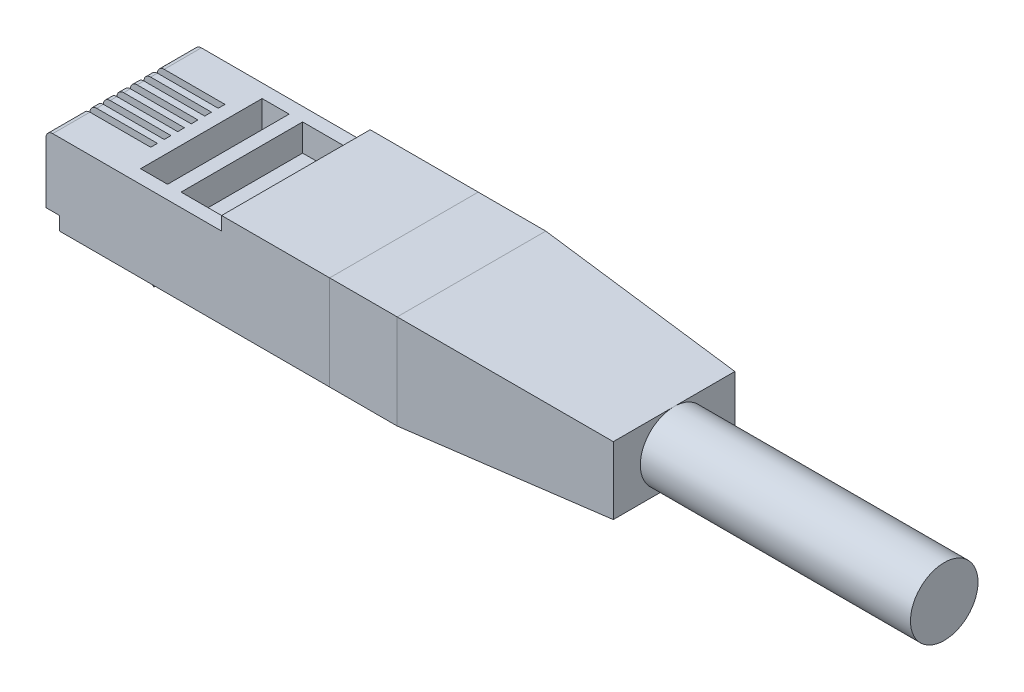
ISO-10303-21;
HEADER;
FILE_DESCRIPTION(('STEP AP214'),'2;1');
FILE_NAME('part.step','',(''),(''),'','','');
FILE_SCHEMA(('AUTOMOTIVE_DESIGN { 1 0 10303 214 1 1 1 1 }'));
ENDSEC;
DATA;
#1=APPLICATION_CONTEXT('core data for automotive mechanical design processes');
#2=APPLICATION_PROTOCOL_DEFINITION('international standard','automotive_design',2000,#1);
#3=PRODUCT_CONTEXT('',#1,'mechanical');
#4=PRODUCT('Part','Part','',(#3));
#5=PRODUCT_RELATED_PRODUCT_CATEGORY('part','',(#4));
#6=PRODUCT_DEFINITION_FORMATION('','',#4);
#7=PRODUCT_DEFINITION_CONTEXT('part definition',#1,'design');
#8=PRODUCT_DEFINITION('design','',#6,#7);
#9=PRODUCT_DEFINITION_SHAPE('','',#8);
#10=(LENGTH_UNIT() NAMED_UNIT(*) SI_UNIT(.MILLI.,.METRE.));
#11=(NAMED_UNIT(*) PLANE_ANGLE_UNIT() SI_UNIT($,.RADIAN.));
#12=(NAMED_UNIT(*) SI_UNIT($,.STERADIAN.) SOLID_ANGLE_UNIT());
#13=UNCERTAINTY_MEASURE_WITH_UNIT(LENGTH_MEASURE(1.E-05),#10,'distance_accuracy_value','');
#14=(GEOMETRIC_REPRESENTATION_CONTEXT(3) GLOBAL_UNCERTAINTY_ASSIGNED_CONTEXT((#13)) GLOBAL_UNIT_ASSIGNED_CONTEXT((#10,
#11,#12)) REPRESENTATION_CONTEXT('',''));
#15=CARTESIAN_POINT('',(0.,0.,0.));
#16=DIRECTION('',(0.,0.,1.));
#17=DIRECTION('',(1.,0.,0.));
#18=AXIS2_PLACEMENT_3D('',#15,#16,#17);
#19=CARTESIAN_POINT('',(36.7285444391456,25.5517248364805,-53.3787612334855));
#20=DIRECTION('',(1.,0.,0.));
#21=DIRECTION('',(0.,0.,-1.));
#22=AXIS2_PLACEMENT_3D('',#19,#20,#21);
#23=PLANE('',#22);
#24=DIRECTION('',(0.,0.,-1.));
#25=VECTOR('',#24,1.);
#26=CARTESIAN_POINT('',(36.7285444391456,1.47935495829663,-1.03202265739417));
#27=LINE('',#26,#25);
#28=CARTESIAN_POINT('',(36.7285444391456,1.47935495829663,8.96797734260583));
#29=VERTEX_POINT('',#28);
#30=CARTESIAN_POINT('',(36.7285444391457,1.47935495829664,4.46797734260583));
#31=VERTEX_POINT('',#30);
#32=EDGE_CURVE('P0_E111',#29,#31,#27,.T.);
#33=ORIENTED_EDGE('',*,*,#32,.T.);
#34=CARTESIAN_POINT('',(36.7285444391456,3.97935495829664,4.46797734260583));
#35=DIRECTION('',(1.,0.,0.));
#36=DIRECTION('',(0.,0.,-1.));
#37=AXIS2_PLACEMENT_3D('',#34,#35,#36);
#38=CIRCLE('',#37,2.5);
#39=CARTESIAN_POINT('',(36.7285444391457,6.47935495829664,4.46797734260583));
#40=VERTEX_POINT('',#39);
#41=EDGE_CURVE('P0_E32',#31,#40,#38,.F.);
#42=ORIENTED_EDGE('',*,*,#41,.T.);
#43=DIRECTION('',(0.,0.,1.));
#44=VECTOR('',#43,1.);
#45=CARTESIAN_POINT('',(36.7285444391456,6.47935495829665,9.96797734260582));
#46=LINE('',#45,#44);
#47=CARTESIAN_POINT('',(36.7285444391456,6.47935495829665,8.96797734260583));
#48=VERTEX_POINT('',#47);
#49=EDGE_CURVE('P0_E108',#40,#48,#46,.T.);
#50=ORIENTED_EDGE('',*,*,#49,.T.);
#51=DIRECTION('',(0.,-1.,0.));
#52=VECTOR('',#51,1.);
#53=CARTESIAN_POINT('',(36.7285444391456,0.479354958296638,8.96797734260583));
#54=LINE('',#53,#52);
#55=EDGE_CURVE('P0_E121',#48,#29,#54,.T.);
#56=ORIENTED_EDGE('',*,*,#55,.T.);
#57=EDGE_LOOP('',(#33,#42,#50,#56));
#58=FACE_BOUND('',#57,.T.);
#59=ADVANCED_FACE('P0_F16',(#58),#23,.T.);
#60=CARTESIAN_POINT('',(36.7285444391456,6.47935495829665,-0.0320226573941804));
#61=VERTEX_POINT('',#60);
#62=EDGE_CURVE('P0_E116',#61,#40,#46,.T.);
#63=ORIENTED_EDGE('',*,*,#62,.T.);
#64=EDGE_CURVE('P0_E97',#40,#31,#38,.F.);
#65=ORIENTED_EDGE('',*,*,#64,.T.);
#66=CARTESIAN_POINT('',(36.7285444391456,1.47935495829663,-0.0320226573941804));
#67=VERTEX_POINT('',#66);
#68=EDGE_CURVE('P0_E126',#31,#67,#27,.T.);
#69=ORIENTED_EDGE('',*,*,#68,.T.);
#70=DIRECTION('',(0.,1.,0.));
#71=VECTOR('',#70,1.);
#72=CARTESIAN_POINT('',(36.7285444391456,7.47935495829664,-0.0320226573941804));
#73=LINE('',#72,#71);
#74=EDGE_CURVE('P0_E125',#67,#61,#73,.T.);
#75=ORIENTED_EDGE('',*,*,#74,.T.);
#76=EDGE_LOOP('',(#63,#65,#69,#75));
#77=FACE_BOUND('',#76,.T.);
#78=ADVANCED_FACE('P0_F123',(#77),#23,.T.);
#79=CARTESIAN_POINT('',(16.7285444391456,5.47935495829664,7.96797734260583));
#80=DIRECTION('',(0.,0.,-1.));
#81=DIRECTION('',(0.,1.,0.));
#82=AXIS2_PLACEMENT_3D('',#79,#80,#81);
#83=PLANE('',#82);
#84=DIRECTION('',(0.,-1.,0.));
#85=VECTOR('',#84,1.);
#86=CARTESIAN_POINT('',(8.72854443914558,5.47935495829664,7.96797734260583));
#87=LINE('',#86,#85);
#88=CARTESIAN_POINT('',(8.72854443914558,5.47935495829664,7.96797734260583));
#89=VERTEX_POINT('',#88);
#90=CARTESIAN_POINT('',(8.72854443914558,2.47935495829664,7.96797734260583));
#91=VERTEX_POINT('',#90);
#92=EDGE_CURVE('P0_E168',#89,#91,#87,.T.);
#93=ORIENTED_EDGE('',*,*,#92,.T.);
#94=DIRECTION('',(-1.,0.,0.));
#95=VECTOR('',#94,1.);
#96=CARTESIAN_POINT('',(16.7285444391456,2.47935495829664,7.96797734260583));
#97=LINE('',#96,#95);
#98=CARTESIAN_POINT('',(16.7285444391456,2.47935495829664,7.96797734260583));
#99=VERTEX_POINT('',#98);
#100=EDGE_CURVE('P0_E195',#99,#91,#97,.T.);
#101=ORIENTED_EDGE('',*,*,#100,.F.);
#102=DIRECTION('',(0.,-1.,0.));
#103=VECTOR('',#102,1.);
#104=CARTESIAN_POINT('',(16.7285444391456,5.47935495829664,7.96797734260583));
#105=LINE('',#104,#103);
#106=CARTESIAN_POINT('',(16.7285444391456,5.47935495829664,7.96797734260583));
#107=VERTEX_POINT('',#106);
#108=EDGE_CURVE('P0_E169',#107,#99,#105,.T.);
#109=ORIENTED_EDGE('',*,*,#108,.F.);
#110=DIRECTION('',(-1.,0.,0.));
#111=VECTOR('',#110,1.);
#112=CARTESIAN_POINT('',(16.7285444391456,5.47935495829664,7.96797734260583));
#113=LINE('',#112,#111);
#114=EDGE_CURVE('P0_E180',#107,#89,#113,.T.);
#115=ORIENTED_EDGE('',*,*,#114,.T.);
#116=EDGE_LOOP('',(#93,#101,#109,#115));
#117=FACE_BOUND('',#116,.T.);
#118=ADVANCED_FACE('P0_F219',(#117),#83,.F.);
#119=CARTESIAN_POINT('',(16.7285444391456,2.47935495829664,7.96797734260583));
#120=DIRECTION('',(0.,1.,0.));
#121=DIRECTION('',(1.,0.,0.));
#122=AXIS2_PLACEMENT_3D('',#119,#120,#121);
#123=PLANE('',#122);
#124=DIRECTION('',(0.,0.,-1.));
#125=VECTOR('',#124,1.);
#126=CARTESIAN_POINT('',(8.72854443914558,2.47935495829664,7.96797734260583));
#127=LINE('',#126,#125);
#128=CARTESIAN_POINT('',(8.72854443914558,2.47935495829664,0.967977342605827));
#129=VERTEX_POINT('',#128);
#130=EDGE_CURVE('P0_E183',#91,#129,#127,.T.);
#131=ORIENTED_EDGE('',*,*,#130,.T.);
#132=DIRECTION('',(-1.,0.,0.));
#133=VECTOR('',#132,1.);
#134=CARTESIAN_POINT('',(16.7285444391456,2.47935495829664,0.967977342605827));
#135=LINE('',#134,#133);
#136=CARTESIAN_POINT('',(16.7285444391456,2.47935495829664,0.967977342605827));
#137=VERTEX_POINT('',#136);
#138=EDGE_CURVE('P0_E193',#137,#129,#135,.T.);
#139=ORIENTED_EDGE('',*,*,#138,.F.);
#140=DIRECTION('',(0.,0.,-1.));
#141=VECTOR('',#140,1.);
#142=CARTESIAN_POINT('',(16.7285444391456,2.47935495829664,7.96797734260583));
#143=LINE('',#142,#141);
#144=EDGE_CURVE('P0_E172',#99,#137,#143,.T.);
#145=ORIENTED_EDGE('',*,*,#144,.F.);
#146=ORIENTED_EDGE('',*,*,#100,.T.);
#147=EDGE_LOOP('',(#131,#139,#145,#146));
#148=FACE_BOUND('',#147,.T.);
#149=ADVANCED_FACE('P0_F253',(#148),#123,.F.);
#150=CARTESIAN_POINT('',(16.7285444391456,5.47935495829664,0.967977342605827));
#151=DIRECTION('',(0.,0.,1.));
#152=DIRECTION('',(1.,0.,0.));
#153=AXIS2_PLACEMENT_3D('',#150,#151,#152);
#154=PLANE('',#153);
#155=DIRECTION('',(0.,1.,0.));
#156=VECTOR('',#155,1.);
#157=CARTESIAN_POINT('',(8.72854443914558,5.47935495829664,0.967977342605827));
#158=LINE('',#157,#156);
#159=CARTESIAN_POINT('',(8.72854443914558,5.47935495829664,0.967977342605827));
#160=VERTEX_POINT('',#159);
#161=EDGE_CURVE('P0_E185',#129,#160,#158,.T.);
#162=ORIENTED_EDGE('',*,*,#161,.T.);
#163=DIRECTION('',(-1.,0.,0.));
#164=VECTOR('',#163,1.);
#165=CARTESIAN_POINT('',(16.7285444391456,5.47935495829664,0.967977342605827));
#166=LINE('',#165,#164);
#167=CARTESIAN_POINT('',(16.7285444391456,5.47935495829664,0.967977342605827));
#168=VERTEX_POINT('',#167);
#169=EDGE_CURVE('P0_E190',#168,#160,#166,.T.);
#170=ORIENTED_EDGE('',*,*,#169,.F.);
#171=DIRECTION('',(0.,1.,0.));
#172=VECTOR('',#171,1.);
#173=CARTESIAN_POINT('',(16.7285444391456,5.47935495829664,0.967977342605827));
#174=LINE('',#173,#172);
#175=EDGE_CURVE('P0_E175',#137,#168,#174,.T.);
#176=ORIENTED_EDGE('',*,*,#175,.F.);
#177=ORIENTED_EDGE('',*,*,#138,.T.);
#178=EDGE_LOOP('',(#162,#170,#176,#177));
#179=FACE_BOUND('',#178,.T.);
#180=ADVANCED_FACE('P0_F249',(#179),#154,.F.);
#181=CARTESIAN_POINT('',(16.7285444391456,5.47935495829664,7.96797734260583));
#182=DIRECTION('',(0.,-1.,0.));
#183=DIRECTION('',(-1.,0.,0.));
#184=AXIS2_PLACEMENT_3D('',#181,#182,#183);
#185=PLANE('',#184);
#186=DIRECTION('',(0.,0.,1.));
#187=VECTOR('',#186,1.);
#188=CARTESIAN_POINT('',(8.72854443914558,5.47935495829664,7.96797734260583));
#189=LINE('',#188,#187);
#190=EDGE_CURVE('P0_E173',#160,#89,#189,.T.);
#191=ORIENTED_EDGE('',*,*,#190,.T.);
#192=ORIENTED_EDGE('',*,*,#114,.F.);
#193=DIRECTION('',(0.,0.,1.));
#194=VECTOR('',#193,1.);
#195=CARTESIAN_POINT('',(16.7285444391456,5.47935495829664,7.96797734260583));
#196=LINE('',#195,#194);
#197=EDGE_CURVE('P0_E178',#168,#107,#196,.T.);
#198=ORIENTED_EDGE('',*,*,#197,.F.);
#199=ORIENTED_EDGE('',*,*,#169,.T.);
#200=EDGE_LOOP('',(#191,#192,#198,#199));
#201=FACE_BOUND('',#200,.T.);
#202=ADVANCED_FACE('P0_F245',(#201),#185,.F.);
#203=CARTESIAN_POINT('',(8.72854443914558,25.5517248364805,-53.3787612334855));
#204=DIRECTION('',(1.,0.,0.));
#205=DIRECTION('',(0.,0.,-1.));
#206=AXIS2_PLACEMENT_3D('',#203,#204,#205);
#207=PLANE('',#206);
#208=ORIENTED_EDGE('',*,*,#92,.F.);
#209=ORIENTED_EDGE('',*,*,#190,.F.);
#210=ORIENTED_EDGE('',*,*,#161,.F.);
#211=ORIENTED_EDGE('',*,*,#130,.F.);
#212=EDGE_LOOP('',(#208,#209,#210,#211));
#213=FACE_BOUND('',#212,.T.);
#214=ADVANCED_FACE('P0_F227',(#213),#207,.F.);
#215=CARTESIAN_POINT('',(16.7285444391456,25.5517248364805,-53.3787612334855));
#216=DIRECTION('',(1.,0.,0.));
#217=DIRECTION('',(0.,0.,-1.));
#218=AXIS2_PLACEMENT_3D('',#215,#216,#217);
#219=PLANE('',#218);
#220=ORIENTED_EDGE('',*,*,#197,.T.);
#221=ORIENTED_EDGE('',*,*,#108,.T.);
#222=ORIENTED_EDGE('',*,*,#144,.T.);
#223=ORIENTED_EDGE('',*,*,#175,.T.);
#224=EDGE_LOOP('',(#220,#221,#222,#223));
#225=FACE_BOUND('',#224,.T.);
#226=DIRECTION('',(0.,-1.,0.));
#227=VECTOR('',#226,1.);
#228=CARTESIAN_POINT('',(16.7285444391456,7.47935495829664,9.96797734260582));
#229=LINE('',#228,#227);
#230=CARTESIAN_POINT('',(16.7285444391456,7.47935495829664,9.96797734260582));
#231=VERTEX_POINT('',#230);
#232=CARTESIAN_POINT('',(16.7285444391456,0.479354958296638,9.96797734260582));
#233=VERTEX_POINT('',#232);
#234=EDGE_CURVE('P0_E144',#231,#233,#229,.T.);
#235=ORIENTED_EDGE('',*,*,#234,.F.);
#236=DIRECTION('',(0.,0.,1.));
#237=VECTOR('',#236,1.);
#238=CARTESIAN_POINT('',(16.7285444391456,7.47935495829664,9.96797734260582));
#239=LINE('',#238,#237);
#240=CARTESIAN_POINT('',(16.7285444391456,7.47935495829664,-1.03202265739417));
#241=VERTEX_POINT('',#240);
#242=EDGE_CURVE('P0_E157',#241,#231,#239,.T.);
#243=ORIENTED_EDGE('',*,*,#242,.F.);
#244=DIRECTION('',(0.,1.,0.));
#245=VECTOR('',#244,1.);
#246=CARTESIAN_POINT('',(16.7285444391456,7.47935495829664,-1.03202265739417));
#247=LINE('',#246,#245);
#248=CARTESIAN_POINT('',(16.7285444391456,0.479354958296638,-1.03202265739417));
#249=VERTEX_POINT('',#248);
#250=EDGE_CURVE('P0_E151',#249,#241,#247,.T.);
#251=ORIENTED_EDGE('',*,*,#250,.F.);
#252=DIRECTION('',(0.,0.,-1.));
#253=VECTOR('',#252,1.);
#254=CARTESIAN_POINT('',(16.7285444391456,0.479354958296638,9.96797734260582));
#255=LINE('',#254,#253);
#256=EDGE_CURVE('P0_E147',#233,#249,#255,.T.);
#257=ORIENTED_EDGE('',*,*,#256,.F.);
#258=EDGE_LOOP('',(#235,#243,#251,#257));
#259=FACE_BOUND('',#258,.T.);
#260=ADVANCED_FACE('P0_F223',(#225,#259),#219,.F.);
#261=CARTESIAN_POINT('',(36.7285444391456,7.47935495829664,9.96797734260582));
#262=DIRECTION('',(0.,0.,-1.));
#263=DIRECTION('',(-1.,0.,0.));
#264=AXIS2_PLACEMENT_3D('',#261,#262,#263);
#265=PLANE('',#264);
#266=DIRECTION('',(-1.,0.,0.));
#267=VECTOR('',#266,1.);
#268=CARTESIAN_POINT('',(36.7285444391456,0.479354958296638,9.96797734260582));
#269=LINE('',#268,#267);
#270=CARTESIAN_POINT('',(21.7285444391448,0.479354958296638,9.96797734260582));
#271=VERTEX_POINT('',#270);
#272=EDGE_CURVE('P0_E166',#271,#233,#269,.T.);
#273=ORIENTED_EDGE('',*,*,#272,.F.);
#274=DIRECTION('',(0.,1.,0.));
#275=VECTOR('',#274,1.);
#276=CARTESIAN_POINT('',(21.7285444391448,7.47935495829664,9.96797734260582));
#277=LINE('',#276,#275);
#278=CARTESIAN_POINT('',(21.7285444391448,7.47935495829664,9.96797734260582));
#279=VERTEX_POINT('',#278);
#280=EDGE_CURVE('P0_E11',#271,#279,#277,.T.);
#281=ORIENTED_EDGE('',*,*,#280,.T.);
#282=DIRECTION('',(-1.,0.,0.));
#283=VECTOR('',#282,1.);
#284=CARTESIAN_POINT('',(36.7285444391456,7.47935495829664,9.96797734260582));
#285=LINE('',#284,#283);
#286=EDGE_CURVE('P0_E160',#279,#231,#285,.T.);
#287=ORIENTED_EDGE('',*,*,#286,.T.);
#288=ORIENTED_EDGE('',*,*,#234,.T.);
#289=EDGE_LOOP('',(#273,#281,#287,#288));
#290=FACE_BOUND('',#289,.T.);
#291=ADVANCED_FACE('P0_F226',(#290),#265,.F.);
#292=CARTESIAN_POINT('',(36.7285444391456,0.479354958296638,9.96797734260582));
#293=DIRECTION('',(0.,1.,0.));
#294=DIRECTION('',(1.,0.,0.));
#295=AXIS2_PLACEMENT_3D('',#292,#293,#294);
#296=PLANE('',#295);
#297=DIRECTION('',(-1.,0.,0.));
#298=VECTOR('',#297,1.);
#299=CARTESIAN_POINT('',(36.7285444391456,0.479354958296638,-1.03202265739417));
#300=LINE('',#299,#298);
#301=CARTESIAN_POINT('',(21.7285444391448,0.479354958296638,-1.03202265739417));
#302=VERTEX_POINT('',#301);
#303=EDGE_CURVE('P0_E164',#302,#249,#300,.T.);
#304=ORIENTED_EDGE('',*,*,#303,.F.);
#305=DIRECTION('',(0.,0.,1.));
#306=VECTOR('',#305,1.);
#307=CARTESIAN_POINT('',(21.7285444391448,0.479354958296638,9.96797734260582));
#308=LINE('',#307,#306);
#309=EDGE_CURVE('P0_E132',#302,#271,#308,.T.);
#310=ORIENTED_EDGE('',*,*,#309,.T.);
#311=ORIENTED_EDGE('',*,*,#272,.T.);
#312=ORIENTED_EDGE('',*,*,#256,.T.);
#313=EDGE_LOOP('',(#304,#310,#311,#312));
#314=FACE_BOUND('',#313,.T.);
#315=ADVANCED_FACE('P0_F236',(#314),#296,.F.);
#316=CARTESIAN_POINT('',(36.7285444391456,7.47935495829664,-1.03202265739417));
#317=DIRECTION('',(0.,0.,1.));
#318=DIRECTION('',(1.,0.,0.));
#319=AXIS2_PLACEMENT_3D('',#316,#317,#318);
#320=PLANE('',#319);
#321=DIRECTION('',(-1.,0.,0.));
#322=VECTOR('',#321,1.);
#323=CARTESIAN_POINT('',(36.7285444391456,7.47935495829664,-1.03202265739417));
#324=LINE('',#323,#322);
#325=CARTESIAN_POINT('',(21.7285444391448,7.47935495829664,-1.03202265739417));
#326=VERTEX_POINT('',#325);
#327=EDGE_CURVE('P0_E162',#326,#241,#324,.T.);
#328=ORIENTED_EDGE('',*,*,#327,.F.);
#329=DIRECTION('',(0.,-1.,0.));
#330=VECTOR('',#329,1.);
#331=CARTESIAN_POINT('',(21.7285444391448,0.479354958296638,-1.03202265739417));
#332=LINE('',#331,#330);
#333=EDGE_CURVE('P0_E135',#326,#302,#332,.T.);
#334=ORIENTED_EDGE('',*,*,#333,.T.);
#335=ORIENTED_EDGE('',*,*,#303,.T.);
#336=ORIENTED_EDGE('',*,*,#250,.T.);
#337=EDGE_LOOP('',(#328,#334,#335,#336));
#338=FACE_BOUND('',#337,.T.);
#339=ADVANCED_FACE('P0_F232',(#338),#320,.F.);
#340=CARTESIAN_POINT('',(36.7285444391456,7.47935495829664,9.96797734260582));
#341=DIRECTION('',(0.,-1.,0.));
#342=DIRECTION('',(-1.,0.,0.));
#343=AXIS2_PLACEMENT_3D('',#340,#341,#342);
#344=PLANE('',#343);
#345=ORIENTED_EDGE('',*,*,#286,.F.);
#346=DIRECTION('',(0.,0.,-1.));
#347=VECTOR('',#346,1.);
#348=CARTESIAN_POINT('',(21.7285444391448,7.47935495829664,-1.03202265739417));
#349=LINE('',#348,#347);
#350=EDGE_CURVE('P0_E25',#279,#326,#349,.T.);
#351=ORIENTED_EDGE('',*,*,#350,.T.);
#352=ORIENTED_EDGE('',*,*,#327,.T.);
#353=ORIENTED_EDGE('',*,*,#242,.T.);
#354=EDGE_LOOP('',(#345,#351,#352,#353));
#355=FACE_BOUND('',#354,.T.);
#356=ADVANCED_FACE('P0_F229',(#355),#344,.F.);
#357=CARTESIAN_POINT('',(36.7285444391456,6.47935495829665,-53.3787612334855));
#358=DIRECTION('',(0.0665190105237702,0.997785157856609,0.));
#359=DIRECTION('',(0.,0.,-1.));
#360=AXIS2_PLACEMENT_3D('',#357,#358,#359);
#361=PLANE('',#360);
#362=DIRECTION('',(-0.995584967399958,0.0663723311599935,-0.0663723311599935));
#363=VECTOR('',#362,1.);
#364=CARTESIAN_POINT('',(33.2034295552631,6.71436261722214,-0.267030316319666));
#365=LINE('',#364,#363);
#366=EDGE_CURVE('P0_E141',#326,#61,#365,.F.);
#367=ORIENTED_EDGE('',*,*,#366,.F.);
#368=ORIENTED_EDGE('',*,*,#350,.F.);
#369=DIRECTION('',(-0.995584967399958,0.0663723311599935,0.0663723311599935));
#370=VECTOR('',#369,1.);
#371=CARTESIAN_POINT('',(35.4682556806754,6.56337420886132,9.05199659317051));
#372=LINE('',#371,#370);
#373=EDGE_CURVE('P0_E20',#48,#279,#372,.T.);
#374=ORIENTED_EDGE('',*,*,#373,.F.);
#375=ORIENTED_EDGE('',*,*,#49,.F.);
#376=ORIENTED_EDGE('',*,*,#62,.F.);
#377=EDGE_LOOP('',(#367,#368,#374,#375,#376));
#378=FACE_BOUND('',#377,.T.);
#379=ADVANCED_FACE('P0_F18',(#378),#361,.T.);
#380=CARTESIAN_POINT('',(36.7285444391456,25.5517248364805,8.96797734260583));
#381=DIRECTION('',(0.0665190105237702,0.,0.997785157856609));
#382=DIRECTION('',(0.,1.,0.));
#383=AXIS2_PLACEMENT_3D('',#380,#381,#382);
#384=PLANE('',#383);
#385=ORIENTED_EDGE('',*,*,#373,.T.);
#386=ORIENTED_EDGE('',*,*,#280,.F.);
#387=DIRECTION('',(0.995584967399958,0.0663723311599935,-0.0663723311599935));
#388=VECTOR('',#387,1.);
#389=CARTESIAN_POINT('',(38.3192296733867,1.58540064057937,8.86193166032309));
#390=LINE('',#389,#388);
#391=EDGE_CURVE('P0_E140',#29,#271,#390,.F.);
#392=ORIENTED_EDGE('',*,*,#391,.F.);
#393=ORIENTED_EDGE('',*,*,#55,.F.);
#394=EDGE_LOOP('',(#385,#386,#392,#393));
#395=FACE_BOUND('',#394,.T.);
#396=ADVANCED_FACE('P0_F200',(#395),#384,.T.);
#397=CARTESIAN_POINT('',(36.7285444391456,25.5517248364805,-0.0320226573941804));
#398=DIRECTION('',(0.0665190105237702,0.,-0.997785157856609));
#399=DIRECTION('',(0.,-1.,0.));
#400=AXIS2_PLACEMENT_3D('',#397,#398,#399);
#401=PLANE('',#400);
#402=ORIENTED_EDGE('',*,*,#366,.T.);
#403=ORIENTED_EDGE('',*,*,#74,.F.);
#404=DIRECTION('',(-0.995584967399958,-0.0663723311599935,-0.0663723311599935));
#405=VECTOR('',#404,1.);
#406=CARTESIAN_POINT('',(38.3192296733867,1.58540064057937,0.0740230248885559));
#407=LINE('',#406,#405);
#408=EDGE_CURVE('P0_E112',#302,#67,#407,.F.);
#409=ORIENTED_EDGE('',*,*,#408,.F.);
#410=ORIENTED_EDGE('',*,*,#333,.F.);
#411=EDGE_LOOP('',(#402,#403,#409,#410));
#412=FACE_BOUND('',#411,.T.);
#413=ADVANCED_FACE('P0_F205',(#412),#401,.T.);
#414=CARTESIAN_POINT('',(36.7285444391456,1.47935495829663,-53.3787612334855));
#415=DIRECTION('',(0.0665190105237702,-0.997785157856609,0.));
#416=DIRECTION('',(0.,0.,1.));
#417=AXIS2_PLACEMENT_3D('',#414,#415,#416);
#418=PLANE('',#417);
#419=ORIENTED_EDGE('',*,*,#391,.T.);
#420=ORIENTED_EDGE('',*,*,#309,.F.);
#421=ORIENTED_EDGE('',*,*,#408,.T.);
#422=ORIENTED_EDGE('',*,*,#68,.F.);
#423=ORIENTED_EDGE('',*,*,#32,.F.);
#424=EDGE_LOOP('',(#419,#420,#421,#422,#423));
#425=FACE_BOUND('',#424,.T.);
#426=ADVANCED_FACE('P0_F203',(#425),#418,.T.);
#427=CARTESIAN_POINT('',(56.7285444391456,3.97935495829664,4.46797734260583));
#428=DIRECTION('',(-1.,0.,0.));
#429=DIRECTION('',(0.,0.,1.));
#430=AXIS2_PLACEMENT_3D('',#427,#428,#429);
#431=CYLINDRICAL_SURFACE('',#430,2.5);
#432=ORIENTED_EDGE('',*,*,#41,.F.);
#433=ORIENTED_EDGE('',*,*,#64,.F.);
#434=EDGE_LOOP('',(#432,#433));
#435=FACE_BOUND('',#434,.T.);
#436=CARTESIAN_POINT('',(56.7285444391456,3.97935495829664,4.46797734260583));
#437=DIRECTION('',(1.,0.,0.));
#438=DIRECTION('',(0.,0.,-1.));
#439=AXIS2_PLACEMENT_3D('',#436,#437,#438);
#440=CIRCLE('',#439,2.5);
#441=CARTESIAN_POINT('',(56.7285444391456,3.97935495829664,1.96797734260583));
#442=VERTEX_POINT('',#441);
#443=EDGE_CURVE('P0_E103',#442,#442,#440,.T.);
#444=ORIENTED_EDGE('',*,*,#443,.F.);
#445=EDGE_LOOP('',(#444));
#446=FACE_BOUND('',#445,.T.);
#447=ADVANCED_FACE('P0_F98',(#435,#446),#431,.T.);
#448=CARTESIAN_POINT('',(56.7285444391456,3.97935495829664,4.46797734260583));
#449=DIRECTION('',(1.,0.,0.));
#450=DIRECTION('',(0.,0.,-1.));
#451=AXIS2_PLACEMENT_3D('',#448,#449,#450);
#452=PLANE('',#451);
#453=ORIENTED_EDGE('',*,*,#443,.T.);
#454=EDGE_LOOP('',(#453));
#455=FACE_BOUND('',#454,.T.);
#456=ADVANCED_FACE('P0_F346',(#455),#452,.T.);
#457=CLOSED_SHELL('',(#59,#78,#118,#149,#180,#202,#214,#260,#291,#315,#339,#356,#379,#396,#413,
#426,#447,#456));
#458=MANIFOLD_SOLID_BREP('P0_B1',#457);
#459=CARTESIAN_POINT('',(1.72096864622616,-0.00501417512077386,0.96797734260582));
#460=DIRECTION('',(1.,0.,0.));
#461=DIRECTION('',(0.,0.,-1.));
#462=AXIS2_PLACEMENT_3D('',#459,#460,#461);
#463=PLANE('',#462);
#464=DIRECTION('',(0.,0.,1.));
#465=VECTOR('',#464,1.);
#466=CARTESIAN_POINT('',(1.72096864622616,-0.00501417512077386,0.96797734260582));
#467=LINE('',#466,#465);
#468=CARTESIAN_POINT('',(1.72096864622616,-0.00501417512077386,0.96797734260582));
#469=VERTEX_POINT('',#468);
#470=CARTESIAN_POINT('',(1.72096864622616,-0.00501417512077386,2.87797734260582));
#471=VERTEX_POINT('',#470);
#472=EDGE_CURVE('P1_E439',#469,#471,#467,.T.);
#473=ORIENTED_EDGE('',*,*,#472,.T.);
#474=DIRECTION('',(0.,-1.,0.));
#475=VECTOR('',#474,1.);
#476=CARTESIAN_POINT('',(1.72096864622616,-1.61617476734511,2.87797734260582));
#477=LINE('',#476,#475);
#478=CARTESIAN_POINT('',(1.72096864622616,-1.61617476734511,2.87797734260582));
#479=VERTEX_POINT('',#478);
#480=EDGE_CURVE('P1_E412',#471,#479,#477,.T.);
#481=ORIENTED_EDGE('',*,*,#480,.T.);
#482=DIRECTION('',(0.,0.,1.));
#483=VECTOR('',#482,1.);
#484=CARTESIAN_POINT('',(1.72096864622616,-1.61617476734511,0.96797734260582));
#485=LINE('',#484,#483);
#486=CARTESIAN_POINT('',(1.72096864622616,-1.61617476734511,0.96797734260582));
#487=VERTEX_POINT('',#486);
#488=EDGE_CURVE('P1_E453',#487,#479,#485,.T.);
#489=ORIENTED_EDGE('',*,*,#488,.F.);
#490=DIRECTION('',(0.,1.,0.));
#491=VECTOR('',#490,1.);
#492=CARTESIAN_POINT('',(1.72096864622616,-0.00501417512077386,0.96797734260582));
#493=LINE('',#492,#491);
#494=EDGE_CURVE('P1_E446',#487,#469,#493,.T.);
#495=ORIENTED_EDGE('',*,*,#494,.T.);
#496=EDGE_LOOP('',(#473,#481,#489,#495));
#497=FACE_BOUND('',#496,.T.);
#498=ADVANCED_FACE('P1_F16',(#497),#463,.T.);
#499=CARTESIAN_POINT('',(0.728544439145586,0.479354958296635,60.7928997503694));
#500=DIRECTION('',(0.,-1.,0.));
#501=DIRECTION('',(0.,0.,1.));
#502=AXIS2_PLACEMENT_3D('',#499,#500,#501);
#503=PLANE('',#502);
#504=DIRECTION('',(0.,0.,1.));
#505=VECTOR('',#504,1.);
#506=CARTESIAN_POINT('',(-1.27145556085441,0.479354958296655,0.967977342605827));
#507=LINE('',#506,#505);
#508=CARTESIAN_POINT('',(-1.27145556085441,0.479354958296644,0.96797734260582));
#509=VERTEX_POINT('',#508);
#510=CARTESIAN_POINT('',(-1.27145556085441,0.479354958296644,7.96797734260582));
#511=VERTEX_POINT('',#510);
#512=EDGE_CURVE('P1_E451',#509,#511,#507,.T.);
#513=ORIENTED_EDGE('',*,*,#512,.F.);
#514=DIRECTION('',(1.,0.,0.));
#515=VECTOR('',#514,1.);
#516=CARTESIAN_POINT('',(-4.27145556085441,0.479354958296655,0.967977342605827));
#517=LINE('',#516,#515);
#518=CARTESIAN_POINT('',(-3.27145556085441,0.479354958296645,0.967977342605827));
#519=VERTEX_POINT('',#518);
#520=EDGE_CURVE('P1_E448',#519,#509,#517,.T.);
#521=ORIENTED_EDGE('',*,*,#520,.F.);
#522=DIRECTION('',(0.,0.,1.));
#523=VECTOR('',#522,1.);
#524=CARTESIAN_POINT('',(-3.27145556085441,0.479354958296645,0.967977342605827));
#525=LINE('',#524,#523);
#526=CARTESIAN_POINT('',(-3.27145556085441,0.479354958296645,-1.03202265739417));
#527=VERTEX_POINT('',#526);
#528=EDGE_CURVE('P1_E1014',#527,#519,#525,.T.);
#529=ORIENTED_EDGE('',*,*,#528,.F.);
#530=DIRECTION('',(-1.,0.,0.));
#531=VECTOR('',#530,1.);
#532=CARTESIAN_POINT('',(0.728544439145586,0.479354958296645,-1.03202265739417));
#533=LINE('',#532,#531);
#534=CARTESIAN_POINT('',(16.7285444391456,0.479354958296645,-1.03202265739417));
#535=VERTEX_POINT('',#534);
#536=EDGE_CURVE('P1_E476',#535,#527,#533,.T.);
#537=ORIENTED_EDGE('',*,*,#536,.F.);
#538=DIRECTION('',(0.,0.,-1.));
#539=VECTOR('',#538,1.);
#540=CARTESIAN_POINT('',(16.7285444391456,0.479354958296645,9.96797734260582));
#541=LINE('',#540,#539);
#542=CARTESIAN_POINT('',(16.7285444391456,0.479354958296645,9.96797734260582));
#543=VERTEX_POINT('',#542);
#544=EDGE_CURVE('P1_E1047',#543,#535,#541,.T.);
#545=ORIENTED_EDGE('',*,*,#544,.F.);
#546=DIRECTION('',(-1.,0.,0.));
#547=VECTOR('',#546,1.);
#548=CARTESIAN_POINT('',(0.728544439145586,0.479354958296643,9.96797734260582));
#549=LINE('',#548,#547);
#550=CARTESIAN_POINT('',(-3.27145556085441,0.479354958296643,9.96797734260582));
#551=VERTEX_POINT('',#550);
#552=EDGE_CURVE('P1_E484',#543,#551,#549,.T.);
#553=ORIENTED_EDGE('',*,*,#552,.T.);
#554=DIRECTION('',(0.,0.,1.));
#555=VECTOR('',#554,1.);
#556=CARTESIAN_POINT('',(-3.27145556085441,0.479354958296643,9.96797734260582));
#557=LINE('',#556,#555);
#558=CARTESIAN_POINT('',(-3.27145556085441,0.479354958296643,7.96797734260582));
#559=VERTEX_POINT('',#558);
#560=EDGE_CURVE('P1_E985',#559,#551,#557,.T.);
#561=ORIENTED_EDGE('',*,*,#560,.F.);
#562=DIRECTION('',(-1.,0.,0.));
#563=VECTOR('',#562,1.);
#564=CARTESIAN_POINT('',(-4.27145556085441,0.479354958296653,7.96797734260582));
#565=LINE('',#564,#563);
#566=EDGE_CURVE('P1_E981',#511,#559,#565,.T.);
#567=ORIENTED_EDGE('',*,*,#566,.F.);
#568=EDGE_LOOP('',(#513,#521,#529,#537,#545,#553,#561,#567));
#569=FACE_BOUND('',#568,.T.);
#570=ADVANCED_FACE('P1_F902',(#569),#503,.T.);
#571=CARTESIAN_POINT('',(0.728544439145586,0.479354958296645,9.96797734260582));
#572=DIRECTION('',(0.,0.,-1.));
#573=DIRECTION('',(-1.,0.,0.));
#574=AXIS2_PLACEMENT_3D('',#571,#572,#573);
#575=PLANE('',#574);
#576=DIRECTION('',(-1.,0.,0.));
#577=VECTOR('',#576,1.);
#578=CARTESIAN_POINT('',(0.728544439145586,6.47935495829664,9.96797734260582));
#579=LINE('',#578,#577);
#580=CARTESIAN_POINT('',(8.72854443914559,6.47935495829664,9.96797734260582));
#581=VERTEX_POINT('',#580);
#582=CARTESIAN_POINT('',(-3.77145556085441,6.47935495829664,9.96797734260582));
#583=VERTEX_POINT('',#582);
#584=EDGE_CURVE('P1_E480',#581,#583,#579,.T.);
#585=ORIENTED_EDGE('',*,*,#584,.T.);
#586=CARTESIAN_POINT('',(-3.77145556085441,5.97935495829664,9.96797734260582));
#587=DIRECTION('',(0.,0.,-1.));
#588=DIRECTION('',(-1.,0.,0.));
#589=AXIS2_PLACEMENT_3D('',#586,#587,#588);
#590=CIRCLE('',#589,0.5);
#591=CARTESIAN_POINT('',(-4.27145556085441,5.97935495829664,9.96797734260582));
#592=VERTEX_POINT('',#591);
#593=EDGE_CURVE('P1_E24',#583,#592,#590,.F.);
#594=ORIENTED_EDGE('',*,*,#593,.T.);
#595=DIRECTION('',(0.,-1.,0.));
#596=VECTOR('',#595,1.);
#597=CARTESIAN_POINT('',(-4.27145556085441,0.479354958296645,9.96797734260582));
#598=LINE('',#597,#596);
#599=CARTESIAN_POINT('',(-4.27145556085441,1.47935495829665,9.96797734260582));
#600=VERTEX_POINT('',#599);
#601=EDGE_CURVE('P1_E570',#592,#600,#598,.T.);
#602=ORIENTED_EDGE('',*,*,#601,.T.);
#603=DIRECTION('',(-1.,0.,0.));
#604=VECTOR('',#603,1.);
#605=CARTESIAN_POINT('',(-3.27145556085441,1.47935495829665,9.96797734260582));
#606=LINE('',#605,#604);
#607=CARTESIAN_POINT('',(-3.27145556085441,1.47935495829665,9.96797734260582));
#608=VERTEX_POINT('',#607);
#609=EDGE_CURVE('P1_E999',#608,#600,#606,.T.);
#610=ORIENTED_EDGE('',*,*,#609,.F.);
#611=DIRECTION('',(0.,1.,0.));
#612=VECTOR('',#611,1.);
#613=CARTESIAN_POINT('',(-3.27145556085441,0.479354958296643,9.96797734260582));
#614=LINE('',#613,#612);
#615=EDGE_CURVE('P1_E990',#551,#608,#614,.T.);
#616=ORIENTED_EDGE('',*,*,#615,.F.);
#617=ORIENTED_EDGE('',*,*,#552,.F.);
#618=DIRECTION('',(0.,-1.,0.));
#619=VECTOR('',#618,1.);
#620=CARTESIAN_POINT('',(16.7285444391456,0.479354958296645,9.96797734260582));
#621=LINE('',#620,#619);
#622=CARTESIAN_POINT('',(16.7285444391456,7.47935495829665,9.96797734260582));
#623=VERTEX_POINT('',#622);
#624=EDGE_CURVE('P1_E797',#623,#543,#621,.T.);
#625=ORIENTED_EDGE('',*,*,#624,.F.);
#626=DIRECTION('',(-1.,0.,0.));
#627=VECTOR('',#626,1.);
#628=CARTESIAN_POINT('',(16.7285444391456,7.47935495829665,9.96797734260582));
#629=LINE('',#628,#627);
#630=CARTESIAN_POINT('',(8.72854443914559,7.47935495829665,9.96797734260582));
#631=VERTEX_POINT('',#630);
#632=EDGE_CURVE('P1_E811',#623,#631,#629,.T.);
#633=ORIENTED_EDGE('',*,*,#632,.T.);
#634=DIRECTION('',(0.,-1.,0.));
#635=VECTOR('',#634,1.);
#636=CARTESIAN_POINT('',(8.72854443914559,0.479354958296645,9.96797734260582));
#637=LINE('',#636,#635);
#638=EDGE_CURVE('P1_E795',#631,#581,#637,.T.);
#639=ORIENTED_EDGE('',*,*,#638,.T.);
#640=EDGE_LOOP('',(#585,#594,#602,#610,#616,#617,#625,#633,#639));
#641=FACE_BOUND('',#640,.T.);
#642=ADVANCED_FACE('P1_F727',(#641),#575,.F.);
#643=CARTESIAN_POINT('',(0.728544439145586,0.479354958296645,-1.03202265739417));
#644=DIRECTION('',(0.,0.,-1.));
#645=DIRECTION('',(-1.,0.,0.));
#646=AXIS2_PLACEMENT_3D('',#643,#644,#645);
#647=PLANE('',#646);
#648=DIRECTION('',(0.,-1.,0.));
#649=VECTOR('',#648,1.);
#650=CARTESIAN_POINT('',(-4.27145556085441,0.479354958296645,-1.03202265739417));
#651=LINE('',#650,#649);
#652=CARTESIAN_POINT('',(-4.27145556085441,5.97935495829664,-1.03202265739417));
#653=VERTEX_POINT('',#652);
#654=CARTESIAN_POINT('',(-4.27145556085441,1.47935495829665,-1.03202265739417));
#655=VERTEX_POINT('',#654);
#656=EDGE_CURVE('P1_E632',#653,#655,#651,.T.);
#657=ORIENTED_EDGE('',*,*,#656,.F.);
#658=CARTESIAN_POINT('',(-3.77145556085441,5.97935495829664,-1.03202265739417));
#659=DIRECTION('',(0.,0.,-1.));
#660=DIRECTION('',(-1.,0.,0.));
#661=AXIS2_PLACEMENT_3D('',#658,#659,#660);
#662=CIRCLE('',#661,0.5);
#663=CARTESIAN_POINT('',(-3.77145556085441,6.47935495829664,-1.03202265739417));
#664=VERTEX_POINT('',#663);
#665=EDGE_CURVE('P1_E704',#653,#664,#662,.T.);
#666=ORIENTED_EDGE('',*,*,#665,.T.);
#667=DIRECTION('',(-1.,0.,0.));
#668=VECTOR('',#667,1.);
#669=CARTESIAN_POINT('',(0.728544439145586,6.47935495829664,-1.03202265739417));
#670=LINE('',#669,#668);
#671=CARTESIAN_POINT('',(8.72854443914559,6.47935495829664,-1.03202265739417));
#672=VERTEX_POINT('',#671);
#673=EDGE_CURVE('P1_E473',#672,#664,#670,.T.);
#674=ORIENTED_EDGE('',*,*,#673,.F.);
#675=DIRECTION('',(0.,1.,0.));
#676=VECTOR('',#675,1.);
#677=CARTESIAN_POINT('',(8.72854443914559,0.479354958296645,-1.03202265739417));
#678=LINE('',#677,#676);
#679=CARTESIAN_POINT('',(8.72854443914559,7.47935495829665,-1.03202265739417));
#680=VERTEX_POINT('',#679);
#681=EDGE_CURVE('P1_E790',#672,#680,#678,.T.);
#682=ORIENTED_EDGE('',*,*,#681,.T.);
#683=DIRECTION('',(-1.,0.,0.));
#684=VECTOR('',#683,1.);
#685=CARTESIAN_POINT('',(16.7285444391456,7.47935495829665,-1.03202265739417));
#686=LINE('',#685,#684);
#687=CARTESIAN_POINT('',(16.7285444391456,7.47935495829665,-1.03202265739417));
#688=VERTEX_POINT('',#687);
#689=EDGE_CURVE('P1_E813',#688,#680,#686,.T.);
#690=ORIENTED_EDGE('',*,*,#689,.F.);
#691=DIRECTION('',(0.,1.,0.));
#692=VECTOR('',#691,1.);
#693=CARTESIAN_POINT('',(16.7285444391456,0.479354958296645,-1.03202265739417));
#694=LINE('',#693,#692);
#695=EDGE_CURVE('P1_E1050',#535,#688,#694,.T.);
#696=ORIENTED_EDGE('',*,*,#695,.F.);
#697=ORIENTED_EDGE('',*,*,#536,.T.);
#698=DIRECTION('',(0.,-1.,0.));
#699=VECTOR('',#698,1.);
#700=CARTESIAN_POINT('',(-3.27145556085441,1.47935495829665,-1.03202265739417));
#701=LINE('',#700,#699);
#702=CARTESIAN_POINT('',(-3.27145556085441,1.47935495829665,-1.03202265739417));
#703=VERTEX_POINT('',#702);
#704=EDGE_CURVE('P1_E1012',#703,#527,#701,.T.);
#705=ORIENTED_EDGE('',*,*,#704,.F.);
#706=DIRECTION('',(-1.,0.,0.));
#707=VECTOR('',#706,1.);
#708=CARTESIAN_POINT('',(-3.27145556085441,1.47935495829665,-1.03202265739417));
#709=LINE('',#708,#707);
#710=EDGE_CURVE('P1_E1020',#703,#655,#709,.T.);
#711=ORIENTED_EDGE('',*,*,#710,.T.);
#712=EDGE_LOOP('',(#657,#666,#674,#682,#690,#696,#697,#705,#711));
#713=FACE_BOUND('',#712,.T.);
#714=ADVANCED_FACE('P1_F783',(#713),#647,.T.);
#715=CARTESIAN_POINT('',(0.728544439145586,6.47935495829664,60.7928997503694));
#716=DIRECTION('',(0.,-1.,0.));
#717=DIRECTION('',(1.,0.,0.));
#718=AXIS2_PLACEMENT_3D('',#715,#716,#717);
#719=PLANE('',#718);
#720=DIRECTION('',(0.,0.,1.));
#721=VECTOR('',#720,1.);
#722=CARTESIAN_POINT('',(4.72854443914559,6.47935495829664,-0.0320226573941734));
#723=LINE('',#722,#721);
#724=CARTESIAN_POINT('',(4.72854443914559,6.47935495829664,-0.0320226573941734));
#725=VERTEX_POINT('',#724);
#726=CARTESIAN_POINT('',(4.72854443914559,6.47935495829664,8.96797734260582));
#727=VERTEX_POINT('',#726);
#728=EDGE_CURVE('P1_E818',#725,#727,#723,.T.);
#729=ORIENTED_EDGE('',*,*,#728,.F.);
#730=DIRECTION('',(-1.,0.,0.));
#731=VECTOR('',#730,1.);
#732=CARTESIAN_POINT('',(4.72854443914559,6.47935495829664,-0.0320226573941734));
#733=LINE('',#732,#731);
#734=CARTESIAN_POINT('',(7.72854443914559,6.47935495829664,-0.0320226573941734));
#735=VERTEX_POINT('',#734);
#736=EDGE_CURVE('P1_E815',#735,#725,#733,.T.);
#737=ORIENTED_EDGE('',*,*,#736,.F.);
#738=DIRECTION('',(0.,0.,-1.));
#739=VECTOR('',#738,1.);
#740=CARTESIAN_POINT('',(7.72854443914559,6.47935495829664,-0.0320226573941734));
#741=LINE('',#740,#739);
#742=CARTESIAN_POINT('',(7.72854443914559,6.47935495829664,8.96797734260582));
#743=VERTEX_POINT('',#742);
#744=EDGE_CURVE('P1_E832',#743,#735,#741,.T.);
#745=ORIENTED_EDGE('',*,*,#744,.F.);
#746=DIRECTION('',(1.,0.,0.));
#747=VECTOR('',#746,1.);
#748=CARTESIAN_POINT('',(7.72854443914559,6.47935495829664,8.96797734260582));
#749=LINE('',#748,#747);
#750=EDGE_CURVE('P1_E824',#727,#743,#749,.T.);
#751=ORIENTED_EDGE('',*,*,#750,.F.);
#752=EDGE_LOOP('',(#729,#737,#745,#751));
#753=FACE_BOUND('',#752,.T.);
#754=DIRECTION('',(0.,0.,1.));
#755=VECTOR('',#754,1.);
#756=CARTESIAN_POINT('',(1.72854443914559,6.47935495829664,-0.0320226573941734));
#757=LINE('',#756,#755);
#758=CARTESIAN_POINT('',(1.72854443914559,6.47935495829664,-0.0320226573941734));
#759=VERTEX_POINT('',#758);
#760=CARTESIAN_POINT('',(1.72854443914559,6.47935495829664,8.96797734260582));
#761=VERTEX_POINT('',#760);
#762=EDGE_CURVE('P1_E858',#759,#761,#757,.T.);
#763=ORIENTED_EDGE('',*,*,#762,.F.);
#764=DIRECTION('',(-1.,0.,0.));
#765=VECTOR('',#764,1.);
#766=CARTESIAN_POINT('',(1.72854443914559,6.47935495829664,-0.0320226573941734));
#767=LINE('',#766,#765);
#768=CARTESIAN_POINT('',(3.72854443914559,6.47935495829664,-0.0320226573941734));
#769=VERTEX_POINT('',#768);
#770=EDGE_CURVE('P1_E837',#769,#759,#767,.T.);
#771=ORIENTED_EDGE('',*,*,#770,.F.);
#772=DIRECTION('',(0.,0.,-1.));
#773=VECTOR('',#772,1.);
#774=CARTESIAN_POINT('',(3.72854443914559,6.47935495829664,-0.0320226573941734));
#775=LINE('',#774,#773);
#776=CARTESIAN_POINT('',(3.72854443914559,6.47935495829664,8.96797734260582));
#777=VERTEX_POINT('',#776);
#778=EDGE_CURVE('P1_E848',#777,#769,#775,.T.);
#779=ORIENTED_EDGE('',*,*,#778,.F.);
#780=DIRECTION('',(1.,0.,0.));
#781=VECTOR('',#780,1.);
#782=CARTESIAN_POINT('',(1.72854443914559,6.47935495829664,8.96797734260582));
#783=LINE('',#782,#781);
#784=EDGE_CURVE('P1_E861',#761,#777,#783,.T.);
#785=ORIENTED_EDGE('',*,*,#784,.F.);
#786=EDGE_LOOP('',(#763,#771,#779,#785));
#787=FACE_BOUND('',#786,.T.);
#788=ORIENTED_EDGE('',*,*,#673,.T.);
#789=DIRECTION('',(0.,0.,1.));
#790=VECTOR('',#789,1.);
#791=CARTESIAN_POINT('',(-3.77145556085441,6.47935495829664,1.71797734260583));
#792=LINE('',#791,#790);
#793=CARTESIAN_POINT('',(-3.77145556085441,6.47935495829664,1.71797734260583));
#794=VERTEX_POINT('',#793);
#795=EDGE_CURVE('P1_E770',#664,#794,#792,.T.);
#796=ORIENTED_EDGE('',*,*,#795,.T.);
#797=DIRECTION('',(-1.,0.,0.));
#798=VECTOR('',#797,1.);
#799=CARTESIAN_POINT('',(0.728544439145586,6.47935495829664,1.71797734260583));
#800=LINE('',#799,#798);
#801=CARTESIAN_POINT('',(0.728544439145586,6.47935495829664,1.71797734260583));
#802=VERTEX_POINT('',#801);
#803=EDGE_CURVE('P1_E477',#802,#794,#800,.T.);
#804=ORIENTED_EDGE('',*,*,#803,.F.);
#805=DIRECTION('',(0.,0.,1.));
#806=VECTOR('',#805,1.);
#807=CARTESIAN_POINT('',(0.728544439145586,6.47935495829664,9.96797734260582));
#808=LINE('',#807,#806);
#809=CARTESIAN_POINT('',(0.728544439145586,6.47935495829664,2.21797734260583));
#810=VERTEX_POINT('',#809);
#811=EDGE_CURVE('P1_E490',#802,#810,#808,.T.);
#812=ORIENTED_EDGE('',*,*,#811,.T.);
#813=DIRECTION('',(-1.,0.,0.));
#814=VECTOR('',#813,1.);
#815=CARTESIAN_POINT('',(0.728544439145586,6.47935495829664,2.21797734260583));
#816=LINE('',#815,#814);
#817=CARTESIAN_POINT('',(-3.77145556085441,6.47935495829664,2.21797734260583));
#818=VERTEX_POINT('',#817);
#819=EDGE_CURVE('P1_E644',#810,#818,#816,.T.);
#820=ORIENTED_EDGE('',*,*,#819,.T.);
#821=DIRECTION('',(0.,0.,1.));
#822=VECTOR('',#821,1.);
#823=CARTESIAN_POINT('',(-3.77145556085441,6.47935495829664,2.71797734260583));
#824=LINE('',#823,#822);
#825=CARTESIAN_POINT('',(-3.77145556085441,6.47935495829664,2.71797734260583));
#826=VERTEX_POINT('',#825);
#827=EDGE_CURVE('P1_E767',#818,#826,#824,.T.);
#828=ORIENTED_EDGE('',*,*,#827,.T.);
#829=DIRECTION('',(-1.,0.,0.));
#830=VECTOR('',#829,1.);
#831=CARTESIAN_POINT('',(0.728544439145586,6.47935495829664,2.71797734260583));
#832=LINE('',#831,#830);
#833=CARTESIAN_POINT('',(0.728544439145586,6.47935495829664,2.71797734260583));
#834=VERTEX_POINT('',#833);
#835=EDGE_CURVE('P1_E647',#834,#826,#832,.T.);
#836=ORIENTED_EDGE('',*,*,#835,.F.);
#837=CARTESIAN_POINT('',(0.728544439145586,6.47935495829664,3.21797734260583));
#838=VERTEX_POINT('',#837);
#839=EDGE_CURVE('P1_E507',#834,#838,#808,.T.);
#840=ORIENTED_EDGE('',*,*,#839,.T.);
#841=DIRECTION('',(-1.,0.,0.));
#842=VECTOR('',#841,1.);
#843=CARTESIAN_POINT('',(0.728544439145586,6.47935495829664,3.21797734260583));
#844=LINE('',#843,#842);
#845=CARTESIAN_POINT('',(-3.77145556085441,6.47935495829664,3.21797734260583));
#846=VERTEX_POINT('',#845);
#847=EDGE_CURVE('P1_E651',#838,#846,#844,.T.);
#848=ORIENTED_EDGE('',*,*,#847,.T.);
#849=DIRECTION('',(0.,0.,1.));
#850=VECTOR('',#849,1.);
#851=CARTESIAN_POINT('',(-3.77145556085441,6.47935495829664,3.71797734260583));
#852=LINE('',#851,#850);
#853=CARTESIAN_POINT('',(-3.77145556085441,6.47935495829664,3.71797734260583));
#854=VERTEX_POINT('',#853);
#855=EDGE_CURVE('P1_E764',#846,#854,#852,.T.);
#856=ORIENTED_EDGE('',*,*,#855,.T.);
#857=DIRECTION('',(-1.,0.,0.));
#858=VECTOR('',#857,1.);
#859=CARTESIAN_POINT('',(0.728544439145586,6.47935495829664,3.71797734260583));
#860=LINE('',#859,#858);
#861=CARTESIAN_POINT('',(0.728544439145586,6.47935495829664,3.71797734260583));
#862=VERTEX_POINT('',#861);
#863=EDGE_CURVE('P1_E655',#862,#854,#860,.T.);
#864=ORIENTED_EDGE('',*,*,#863,.F.);
#865=CARTESIAN_POINT('',(0.728544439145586,6.47935495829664,4.21797734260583));
#866=VERTEX_POINT('',#865);
#867=EDGE_CURVE('P1_E510',#862,#866,#808,.T.);
#868=ORIENTED_EDGE('',*,*,#867,.T.);
#869=DIRECTION('',(-1.,0.,0.));
#870=VECTOR('',#869,1.);
#871=CARTESIAN_POINT('',(0.728544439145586,6.47935495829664,4.21797734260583));
#872=LINE('',#871,#870);
#873=CARTESIAN_POINT('',(-3.77145556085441,6.47935495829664,4.21797734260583));
#874=VERTEX_POINT('',#873);
#875=EDGE_CURVE('P1_E659',#866,#874,#872,.T.);
#876=ORIENTED_EDGE('',*,*,#875,.T.);
#877=DIRECTION('',(0.,0.,1.));
#878=VECTOR('',#877,1.);
#879=CARTESIAN_POINT('',(-3.77145556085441,6.47935495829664,4.71797734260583));
#880=LINE('',#879,#878);
#881=CARTESIAN_POINT('',(-3.77145556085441,6.47935495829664,4.71797734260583));
#882=VERTEX_POINT('',#881);
#883=EDGE_CURVE('P1_E757',#874,#882,#880,.T.);
#884=ORIENTED_EDGE('',*,*,#883,.T.);
#885=DIRECTION('',(-1.,0.,0.));
#886=VECTOR('',#885,1.);
#887=CARTESIAN_POINT('',(0.728544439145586,6.47935495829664,4.71797734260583));
#888=LINE('',#887,#886);
#889=CARTESIAN_POINT('',(0.728544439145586,6.47935495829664,4.71797734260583));
#890=VERTEX_POINT('',#889);
#891=EDGE_CURVE('P1_E663',#890,#882,#888,.T.);
#892=ORIENTED_EDGE('',*,*,#891,.F.);
#893=CARTESIAN_POINT('',(0.728544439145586,6.47935495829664,5.21797734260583));
#894=VERTEX_POINT('',#893);
#895=EDGE_CURVE('P1_E512',#890,#894,#808,.T.);
#896=ORIENTED_EDGE('',*,*,#895,.T.);
#897=DIRECTION('',(-1.,0.,0.));
#898=VECTOR('',#897,1.);
#899=CARTESIAN_POINT('',(0.728544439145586,6.47935495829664,5.21797734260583));
#900=LINE('',#899,#898);
#901=CARTESIAN_POINT('',(-3.77145556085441,6.47935495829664,5.21797734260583));
#902=VERTEX_POINT('',#901);
#903=EDGE_CURVE('P1_E666',#894,#902,#900,.T.);
#904=ORIENTED_EDGE('',*,*,#903,.T.);
#905=DIRECTION('',(0.,0.,1.));
#906=VECTOR('',#905,1.);
#907=CARTESIAN_POINT('',(-3.77145556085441,6.47935495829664,5.71797734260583));
#908=LINE('',#907,#906);
#909=CARTESIAN_POINT('',(-3.77145556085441,6.47935495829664,5.71797734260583));
#910=VERTEX_POINT('',#909);
#911=EDGE_CURVE('P1_E754',#902,#910,#908,.T.);
#912=ORIENTED_EDGE('',*,*,#911,.T.);
#913=DIRECTION('',(-1.,0.,0.));
#914=VECTOR('',#913,1.);
#915=CARTESIAN_POINT('',(0.728544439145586,6.47935495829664,5.71797734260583));
#916=LINE('',#915,#914);
#917=CARTESIAN_POINT('',(0.728544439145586,6.47935495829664,5.71797734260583));
#918=VERTEX_POINT('',#917);
#919=EDGE_CURVE('P1_E669',#918,#910,#916,.T.);
#920=ORIENTED_EDGE('',*,*,#919,.F.);
#921=CARTESIAN_POINT('',(0.728544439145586,6.47935495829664,6.21797734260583));
#922=VERTEX_POINT('',#921);
#923=EDGE_CURVE('P1_E514',#918,#922,#808,.T.);
#924=ORIENTED_EDGE('',*,*,#923,.T.);
#925=DIRECTION('',(-1.,0.,0.));
#926=VECTOR('',#925,1.);
#927=CARTESIAN_POINT('',(0.728544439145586,6.47935495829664,6.21797734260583));
#928=LINE('',#927,#926);
#929=CARTESIAN_POINT('',(-3.77145556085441,6.47935495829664,6.21797734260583));
#930=VERTEX_POINT('',#929);
#931=EDGE_CURVE('P1_E542',#922,#930,#928,.T.);
#932=ORIENTED_EDGE('',*,*,#931,.T.);
#933=DIRECTION('',(0.,0.,1.));
#934=VECTOR('',#933,1.);
#935=CARTESIAN_POINT('',(-3.77145556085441,6.47935495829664,6.71797734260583));
#936=LINE('',#935,#934);
#937=CARTESIAN_POINT('',(-3.77145556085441,6.47935495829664,6.71797734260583));
#938=VERTEX_POINT('',#937);
#939=EDGE_CURVE('P1_E753',#930,#938,#936,.T.);
#940=ORIENTED_EDGE('',*,*,#939,.T.);
#941=DIRECTION('',(-1.,0.,0.));
#942=VECTOR('',#941,1.);
#943=CARTESIAN_POINT('',(0.728544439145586,6.47935495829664,6.71797734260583));
#944=LINE('',#943,#942);
#945=CARTESIAN_POINT('',(0.728544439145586,6.47935495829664,6.71797734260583));
#946=VERTEX_POINT('',#945);
#947=EDGE_CURVE('P1_E546',#946,#938,#944,.T.);
#948=ORIENTED_EDGE('',*,*,#947,.F.);
#949=CARTESIAN_POINT('',(0.728544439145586,6.47935495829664,7.21797734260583));
#950=VERTEX_POINT('',#949);
#951=EDGE_CURVE('P1_E516',#946,#950,#808,.T.);
#952=ORIENTED_EDGE('',*,*,#951,.T.);
#953=DIRECTION('',(-1.,0.,0.));
#954=VECTOR('',#953,1.);
#955=CARTESIAN_POINT('',(0.728544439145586,6.47935495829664,7.21797734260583));
#956=LINE('',#955,#954);
#957=CARTESIAN_POINT('',(-3.77145556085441,6.47935495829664,7.21797734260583));
#958=VERTEX_POINT('',#957);
#959=EDGE_CURVE('P1_E563',#950,#958,#956,.T.);
#960=ORIENTED_EDGE('',*,*,#959,.T.);
#961=DIRECTION('',(0.,0.,1.));
#962=VECTOR('',#961,1.);
#963=CARTESIAN_POINT('',(-3.77145556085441,6.47935495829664,9.96797734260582));
#964=LINE('',#963,#962);
#965=EDGE_CURVE('P1_E483',#958,#583,#964,.T.);
#966=ORIENTED_EDGE('',*,*,#965,.T.);
#967=ORIENTED_EDGE('',*,*,#584,.F.);
#968=DIRECTION('',(0.,0.,1.));
#969=VECTOR('',#968,1.);
#970=CARTESIAN_POINT('',(8.72854443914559,6.47935495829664,9.96797734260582));
#971=LINE('',#970,#969);
#972=EDGE_CURVE('P1_E485',#672,#581,#971,.T.);
#973=ORIENTED_EDGE('',*,*,#972,.F.);
#974=EDGE_LOOP('',(#788,#796,#804,#812,#820,#828,#836,#840,#848,#856,#864,#868,#876,#884,#892,
#896,#904,#912,#920,#924,#932,#940,#948,#952,#960,#966,#967,#973));
#975=FACE_BOUND('',#974,.T.);
#976=ADVANCED_FACE('P1_F744',(#753,#787,#975),#719,.F.);
#977=CARTESIAN_POINT('',(0.728544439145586,0.479354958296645,1.71797734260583));
#978=DIRECTION('',(0.,0.,-1.));
#979=DIRECTION('',(-1.,0.,0.));
#980=AXIS2_PLACEMENT_3D('',#977,#978,#979);
#981=PLANE('',#980);
#982=ORIENTED_EDGE('',*,*,#803,.T.);
#983=CARTESIAN_POINT('',(-3.77145556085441,5.97935495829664,1.71797734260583));
#984=DIRECTION('',(0.,0.,-1.));
#985=DIRECTION('',(-1.,0.,0.));
#986=AXIS2_PLACEMENT_3D('',#983,#984,#985);
#987=CIRCLE('',#986,0.5);
#988=CARTESIAN_POINT('',(-4.27145556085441,5.97935495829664,1.71797734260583));
#989=VERTEX_POINT('',#988);
#990=EDGE_CURVE('P1_E695',#794,#989,#987,.F.);
#991=ORIENTED_EDGE('',*,*,#990,.T.);
#992=DIRECTION('',(0.,-1.,0.));
#993=VECTOR('',#992,1.);
#994=CARTESIAN_POINT('',(-4.27145556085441,0.479354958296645,1.71797734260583));
#995=LINE('',#994,#993);
#996=CARTESIAN_POINT('',(-4.27145556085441,4.47935495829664,1.71797734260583));
#997=VERTEX_POINT('',#996);
#998=EDGE_CURVE('P1_E630',#989,#997,#995,.T.);
#999=ORIENTED_EDGE('',*,*,#998,.T.);
#1000=DIRECTION('',(-1.,0.,0.));
#1001=VECTOR('',#1000,1.);
#1002=CARTESIAN_POINT('',(0.728544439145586,4.47935495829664,1.71797734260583));
#1003=LINE('',#1002,#1001);
#1004=CARTESIAN_POINT('',(0.728544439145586,4.47935495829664,1.71797734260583));
#1005=VERTEX_POINT('',#1004);
#1006=EDGE_CURVE('P1_E580',#1005,#997,#1003,.T.);
#1007=ORIENTED_EDGE('',*,*,#1006,.F.);
#1008=DIRECTION('',(0.,-1.,0.));
#1009=VECTOR('',#1008,1.);
#1010=CARTESIAN_POINT('',(0.728544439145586,0.479354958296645,1.71797734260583));
#1011=LINE('',#1010,#1009);
#1012=EDGE_CURVE('P1_E575',#802,#1005,#1011,.T.);
#1013=ORIENTED_EDGE('',*,*,#1012,.F.);
#1014=EDGE_LOOP('',(#982,#991,#999,#1007,#1013));
#1015=FACE_BOUND('',#1014,.T.);
#1016=ADVANCED_FACE('P1_F773',(#1015),#981,.F.);
#1017=CARTESIAN_POINT('',(0.728544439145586,4.47935495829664,60.7928997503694));
#1018=DIRECTION('',(0.,-1.,0.));
#1019=DIRECTION('',(1.,0.,0.));
#1020=AXIS2_PLACEMENT_3D('',#1017,#1018,#1019);
#1021=PLANE('',#1020);
#1022=DIRECTION('',(0.,0.,1.));
#1023=VECTOR('',#1022,1.);
#1024=CARTESIAN_POINT('',(-4.27145556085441,4.47935495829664,60.7928997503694));
#1025=LINE('',#1024,#1023);
#1026=CARTESIAN_POINT('',(-4.27145556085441,4.47935495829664,2.21797734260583));
#1027=VERTEX_POINT('',#1026);
#1028=EDGE_CURVE('P1_E628',#997,#1027,#1025,.T.);
#1029=ORIENTED_EDGE('',*,*,#1028,.T.);
#1030=DIRECTION('',(-1.,0.,0.));
#1031=VECTOR('',#1030,1.);
#1032=CARTESIAN_POINT('',(0.728544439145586,4.47935495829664,2.21797734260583));
#1033=LINE('',#1032,#1031);
#1034=CARTESIAN_POINT('',(0.728544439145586,4.47935495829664,2.21797734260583));
#1035=VERTEX_POINT('',#1034);
#1036=EDGE_CURVE('P1_E641',#1035,#1027,#1033,.T.);
#1037=ORIENTED_EDGE('',*,*,#1036,.F.);
#1038=DIRECTION('',(0.,0.,1.));
#1039=VECTOR('',#1038,1.);
#1040=CARTESIAN_POINT('',(0.728544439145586,4.47935495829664,60.7928997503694));
#1041=LINE('',#1040,#1039);
#1042=EDGE_CURVE('P1_E585',#1005,#1035,#1041,.T.);
#1043=ORIENTED_EDGE('',*,*,#1042,.F.);
#1044=ORIENTED_EDGE('',*,*,#1006,.T.);
#1045=EDGE_LOOP('',(#1029,#1037,#1043,#1044));
#1046=FACE_BOUND('',#1045,.T.);
#1047=ADVANCED_FACE('P1_F1427',(#1046),#1021,.F.);
#1048=CARTESIAN_POINT('',(0.728544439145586,0.479354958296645,2.21797734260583));
#1049=DIRECTION('',(0.,0.,1.));
#1050=DIRECTION('',(1.,0.,0.));
#1051=AXIS2_PLACEMENT_3D('',#1048,#1049,#1050);
#1052=PLANE('',#1051);
#1053=DIRECTION('',(0.,1.,0.));
#1054=VECTOR('',#1053,1.);
#1055=CARTESIAN_POINT('',(-4.27145556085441,0.479354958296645,2.21797734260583));
#1056=LINE('',#1055,#1054);
#1057=CARTESIAN_POINT('',(-4.27145556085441,5.97935495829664,2.21797734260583));
#1058=VERTEX_POINT('',#1057);
#1059=EDGE_CURVE('P1_E626',#1027,#1058,#1056,.T.);
#1060=ORIENTED_EDGE('',*,*,#1059,.T.);
#1061=CARTESIAN_POINT('',(-3.77145556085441,5.97935495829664,2.21797734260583));
#1062=DIRECTION('',(0.,0.,1.));
#1063=DIRECTION('',(1.,0.,0.));
#1064=AXIS2_PLACEMENT_3D('',#1061,#1062,#1063);
#1065=CIRCLE('',#1064,0.5);
#1066=EDGE_CURVE('P1_E708',#1058,#818,#1065,.F.);
#1067=ORIENTED_EDGE('',*,*,#1066,.T.);
#1068=ORIENTED_EDGE('',*,*,#819,.F.);
#1069=DIRECTION('',(0.,1.,0.));
#1070=VECTOR('',#1069,1.);
#1071=CARTESIAN_POINT('',(0.728544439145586,0.479354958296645,2.21797734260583));
#1072=LINE('',#1071,#1070);
#1073=EDGE_CURVE('P1_E586',#1035,#810,#1072,.T.);
#1074=ORIENTED_EDGE('',*,*,#1073,.F.);
#1075=ORIENTED_EDGE('',*,*,#1036,.T.);
#1076=EDGE_LOOP('',(#1060,#1067,#1068,#1074,#1075));
#1077=FACE_BOUND('',#1076,.T.);
#1078=ADVANCED_FACE('P1_F1423',(#1077),#1052,.F.);
#1079=CARTESIAN_POINT('',(0.728544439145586,0.479354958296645,2.71797734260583));
#1080=DIRECTION('',(0.,0.,1.));
#1081=DIRECTION('',(1.,0.,0.));
#1082=AXIS2_PLACEMENT_3D('',#1079,#1080,#1081);
#1083=PLANE('',#1082);
#1084=ORIENTED_EDGE('',*,*,#835,.T.);
#1085=CARTESIAN_POINT('',(-3.77145556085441,5.97935495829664,2.71797734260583));
#1086=DIRECTION('',(0.,0.,1.));
#1087=DIRECTION('',(1.,0.,0.));
#1088=AXIS2_PLACEMENT_3D('',#1085,#1086,#1087);
#1089=CIRCLE('',#1088,0.5);
#1090=CARTESIAN_POINT('',(-4.27145556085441,5.97935495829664,2.71797734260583));
#1091=VERTEX_POINT('',#1090);
#1092=EDGE_CURVE('P1_E706',#826,#1091,#1089,.T.);
#1093=ORIENTED_EDGE('',*,*,#1092,.T.);
#1094=DIRECTION('',(0.,1.,0.));
#1095=VECTOR('',#1094,1.);
#1096=CARTESIAN_POINT('',(-4.27145556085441,0.479354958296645,2.71797734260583));
#1097=LINE('',#1096,#1095);
#1098=CARTESIAN_POINT('',(-4.27145556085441,4.47935495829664,2.71797734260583));
#1099=VERTEX_POINT('',#1098);
#1100=EDGE_CURVE('P1_E624',#1099,#1091,#1097,.T.);
#1101=ORIENTED_EDGE('',*,*,#1100,.F.);
#1102=DIRECTION('',(-1.,0.,0.));
#1103=VECTOR('',#1102,1.);
#1104=CARTESIAN_POINT('',(0.728544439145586,4.47935495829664,2.71797734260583));
#1105=LINE('',#1104,#1103);
#1106=CARTESIAN_POINT('',(0.728544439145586,4.47935495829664,2.71797734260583));
#1107=VERTEX_POINT('',#1106);
#1108=EDGE_CURVE('P1_E645',#1107,#1099,#1105,.T.);
#1109=ORIENTED_EDGE('',*,*,#1108,.F.);
#1110=DIRECTION('',(0.,1.,0.));
#1111=VECTOR('',#1110,1.);
#1112=CARTESIAN_POINT('',(0.728544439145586,0.479354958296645,2.71797734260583));
#1113=LINE('',#1112,#1111);
#1114=EDGE_CURVE('P1_E1458',#1107,#834,#1113,.T.);
#1115=ORIENTED_EDGE('',*,*,#1114,.T.);
#1116=EDGE_LOOP('',(#1084,#1093,#1101,#1109,#1115));
#1117=FACE_BOUND('',#1116,.T.);
#1118=ADVANCED_FACE('P1_F1419',(#1117),#1083,.T.);
#1119=CARTESIAN_POINT('',(0.728544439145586,4.47935495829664,60.7928997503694));
#1120=DIRECTION('',(0.,-1.,0.));
#1121=DIRECTION('',(1.,0.,0.));
#1122=AXIS2_PLACEMENT_3D('',#1119,#1120,#1121);
#1123=PLANE('',#1122);
#1124=DIRECTION('',(0.,0.,1.));
#1125=VECTOR('',#1124,1.);
#1126=CARTESIAN_POINT('',(-4.27145556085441,4.47935495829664,60.7928997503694));
#1127=LINE('',#1126,#1125);
#1128=CARTESIAN_POINT('',(-4.27145556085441,4.47935495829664,3.21797734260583));
#1129=VERTEX_POINT('',#1128);
#1130=EDGE_CURVE('P1_E622',#1099,#1129,#1127,.T.);
#1131=ORIENTED_EDGE('',*,*,#1130,.T.);
#1132=DIRECTION('',(-1.,0.,0.));
#1133=VECTOR('',#1132,1.);
#1134=CARTESIAN_POINT('',(0.728544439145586,4.47935495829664,3.21797734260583));
#1135=LINE('',#1134,#1133);
#1136=CARTESIAN_POINT('',(0.728544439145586,4.47935495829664,3.21797734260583));
#1137=VERTEX_POINT('',#1136);
#1138=EDGE_CURVE('P1_E648',#1137,#1129,#1135,.T.);
#1139=ORIENTED_EDGE('',*,*,#1138,.F.);
#1140=DIRECTION('',(0.,0.,1.));
#1141=VECTOR('',#1140,1.);
#1142=CARTESIAN_POINT('',(0.728544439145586,4.47935495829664,60.7928997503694));
#1143=LINE('',#1142,#1141);
#1144=EDGE_CURVE('P1_E1460',#1107,#1137,#1143,.T.);
#1145=ORIENTED_EDGE('',*,*,#1144,.F.);
#1146=ORIENTED_EDGE('',*,*,#1108,.T.);
#1147=EDGE_LOOP('',(#1131,#1139,#1145,#1146));
#1148=FACE_BOUND('',#1147,.T.);
#1149=ADVANCED_FACE('P1_F1415',(#1148),#1123,.F.);
#1150=CARTESIAN_POINT('',(0.728544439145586,0.479354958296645,3.21797734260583));
#1151=DIRECTION('',(0.,0.,1.));
#1152=DIRECTION('',(1.,0.,0.));
#1153=AXIS2_PLACEMENT_3D('',#1150,#1151,#1152);
#1154=PLANE('',#1153);
#1155=DIRECTION('',(0.,1.,0.));
#1156=VECTOR('',#1155,1.);
#1157=CARTESIAN_POINT('',(-4.27145556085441,0.479354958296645,3.21797734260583));
#1158=LINE('',#1157,#1156);
#1159=CARTESIAN_POINT('',(-4.27145556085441,5.97935495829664,3.21797734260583));
#1160=VERTEX_POINT('',#1159);
#1161=EDGE_CURVE('P1_E619',#1129,#1160,#1158,.T.);
#1162=ORIENTED_EDGE('',*,*,#1161,.T.);
#1163=CARTESIAN_POINT('',(-3.77145556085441,5.97935495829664,3.21797734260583));
#1164=DIRECTION('',(0.,0.,1.));
#1165=DIRECTION('',(1.,0.,0.));
#1166=AXIS2_PLACEMENT_3D('',#1163,#1164,#1165);
#1167=CIRCLE('',#1166,0.5);
#1168=EDGE_CURVE('P1_E712',#1160,#846,#1167,.F.);
#1169=ORIENTED_EDGE('',*,*,#1168,.T.);
#1170=ORIENTED_EDGE('',*,*,#847,.F.);
#1171=DIRECTION('',(0.,1.,0.));
#1172=VECTOR('',#1171,1.);
#1173=CARTESIAN_POINT('',(0.728544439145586,0.479354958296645,3.21797734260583));
#1174=LINE('',#1173,#1172);
#1175=EDGE_CURVE('P1_E1464',#1137,#838,#1174,.T.);
#1176=ORIENTED_EDGE('',*,*,#1175,.F.);
#1177=ORIENTED_EDGE('',*,*,#1138,.T.);
#1178=EDGE_LOOP('',(#1162,#1169,#1170,#1176,#1177));
#1179=FACE_BOUND('',#1178,.T.);
#1180=ADVANCED_FACE('P1_F1411',(#1179),#1154,.F.);
#1181=CARTESIAN_POINT('',(0.728544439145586,0.479354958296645,3.71797734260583));
#1182=DIRECTION('',(0.,0.,-1.));
#1183=DIRECTION('',(-1.,0.,0.));
#1184=AXIS2_PLACEMENT_3D('',#1181,#1182,#1183);
#1185=PLANE('',#1184);
#1186=ORIENTED_EDGE('',*,*,#863,.T.);
#1187=CARTESIAN_POINT('',(-3.77145556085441,5.97935495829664,3.71797734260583));
#1188=DIRECTION('',(0.,0.,-1.));
#1189=DIRECTION('',(-1.,0.,0.));
#1190=AXIS2_PLACEMENT_3D('',#1187,#1188,#1189);
#1191=CIRCLE('',#1190,0.5);
#1192=CARTESIAN_POINT('',(-4.27145556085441,5.97935495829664,3.71797734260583));
#1193=VERTEX_POINT('',#1192);
#1194=EDGE_CURVE('P1_E710',#854,#1193,#1191,.F.);
#1195=ORIENTED_EDGE('',*,*,#1194,.T.);
#1196=DIRECTION('',(0.,-1.,0.));
#1197=VECTOR('',#1196,1.);
#1198=CARTESIAN_POINT('',(-4.27145556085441,0.479354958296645,3.71797734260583));
#1199=LINE('',#1198,#1197);
#1200=CARTESIAN_POINT('',(-4.27145556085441,4.47935495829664,3.71797734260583));
#1201=VERTEX_POINT('',#1200);
#1202=EDGE_CURVE('P1_E617',#1193,#1201,#1199,.T.);
#1203=ORIENTED_EDGE('',*,*,#1202,.T.);
#1204=DIRECTION('',(-1.,0.,0.));
#1205=VECTOR('',#1204,1.);
#1206=CARTESIAN_POINT('',(0.728544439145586,4.47935495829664,3.71797734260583));
#1207=LINE('',#1206,#1205);
#1208=CARTESIAN_POINT('',(0.728544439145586,4.47935495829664,3.71797734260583));
#1209=VERTEX_POINT('',#1208);
#1210=EDGE_CURVE('P1_E652',#1209,#1201,#1207,.T.);
#1211=ORIENTED_EDGE('',*,*,#1210,.F.);
#1212=DIRECTION('',(0.,-1.,0.));
#1213=VECTOR('',#1212,1.);
#1214=CARTESIAN_POINT('',(0.728544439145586,0.479354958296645,3.71797734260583));
#1215=LINE('',#1214,#1213);
#1216=EDGE_CURVE('P1_E1477',#862,#1209,#1215,.T.);
#1217=ORIENTED_EDGE('',*,*,#1216,.F.);
#1218=EDGE_LOOP('',(#1186,#1195,#1203,#1211,#1217));
#1219=FACE_BOUND('',#1218,.T.);
#1220=ADVANCED_FACE('P1_F1407',(#1219),#1185,.F.);
#1221=CARTESIAN_POINT('',(0.728544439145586,4.47935495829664,60.7928997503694));
#1222=DIRECTION('',(0.,-1.,0.));
#1223=DIRECTION('',(1.,0.,0.));
#1224=AXIS2_PLACEMENT_3D('',#1221,#1222,#1223);
#1225=PLANE('',#1224);
#1226=DIRECTION('',(0.,0.,1.));
#1227=VECTOR('',#1226,1.);
#1228=CARTESIAN_POINT('',(-4.27145556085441,4.47935495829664,60.7928997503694));
#1229=LINE('',#1228,#1227);
#1230=CARTESIAN_POINT('',(-4.27145556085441,4.47935495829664,4.21797734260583));
#1231=VERTEX_POINT('',#1230);
#1232=EDGE_CURVE('P1_E614',#1201,#1231,#1229,.T.);
#1233=ORIENTED_EDGE('',*,*,#1232,.T.);
#1234=DIRECTION('',(-1.,0.,0.));
#1235=VECTOR('',#1234,1.);
#1236=CARTESIAN_POINT('',(0.728544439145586,4.47935495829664,4.21797734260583));
#1237=LINE('',#1236,#1235);
#1238=CARTESIAN_POINT('',(0.728544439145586,4.47935495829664,4.21797734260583));
#1239=VERTEX_POINT('',#1238);
#1240=EDGE_CURVE('P1_E656',#1239,#1231,#1237,.T.);
#1241=ORIENTED_EDGE('',*,*,#1240,.F.);
#1242=DIRECTION('',(0.,0.,1.));
#1243=VECTOR('',#1242,1.);
#1244=CARTESIAN_POINT('',(0.728544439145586,4.47935495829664,60.7928997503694));
#1245=LINE('',#1244,#1243);
#1246=EDGE_CURVE('P1_E1475',#1209,#1239,#1245,.T.);
#1247=ORIENTED_EDGE('',*,*,#1246,.F.);
#1248=ORIENTED_EDGE('',*,*,#1210,.T.);
#1249=EDGE_LOOP('',(#1233,#1241,#1247,#1248));
#1250=FACE_BOUND('',#1249,.T.);
#1251=ADVANCED_FACE('P1_F1403',(#1250),#1225,.F.);
#1252=CARTESIAN_POINT('',(0.728544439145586,0.479354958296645,4.21797734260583));
#1253=DIRECTION('',(0.,0.,-1.));
#1254=DIRECTION('',(-1.,0.,0.));
#1255=AXIS2_PLACEMENT_3D('',#1252,#1253,#1254);
#1256=PLANE('',#1255);
#1257=DIRECTION('',(0.,-1.,0.));
#1258=VECTOR('',#1257,1.);
#1259=CARTESIAN_POINT('',(-4.27145556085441,0.479354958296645,4.21797734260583));
#1260=LINE('',#1259,#1258);
#1261=CARTESIAN_POINT('',(-4.27145556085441,5.97935495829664,4.21797734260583));
#1262=VERTEX_POINT('',#1261);
#1263=EDGE_CURVE('P1_E612',#1262,#1231,#1260,.T.);
#1264=ORIENTED_EDGE('',*,*,#1263,.F.);
#1265=CARTESIAN_POINT('',(-3.77145556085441,5.97935495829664,4.21797734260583));
#1266=DIRECTION('',(0.,0.,-1.));
#1267=DIRECTION('',(-1.,0.,0.));
#1268=AXIS2_PLACEMENT_3D('',#1265,#1266,#1267);
#1269=CIRCLE('',#1268,0.5);
#1270=EDGE_CURVE('P1_E716',#1262,#874,#1269,.T.);
#1271=ORIENTED_EDGE('',*,*,#1270,.T.);
#1272=ORIENTED_EDGE('',*,*,#875,.F.);
#1273=DIRECTION('',(0.,-1.,0.));
#1274=VECTOR('',#1273,1.);
#1275=CARTESIAN_POINT('',(0.728544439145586,0.479354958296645,4.21797734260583));
#1276=LINE('',#1275,#1274);
#1277=EDGE_CURVE('P1_E1482',#866,#1239,#1276,.T.);
#1278=ORIENTED_EDGE('',*,*,#1277,.T.);
#1279=ORIENTED_EDGE('',*,*,#1240,.T.);
#1280=EDGE_LOOP('',(#1264,#1271,#1272,#1278,#1279));
#1281=FACE_BOUND('',#1280,.T.);
#1282=ADVANCED_FACE('P1_F1399',(#1281),#1256,.T.);
#1283=CARTESIAN_POINT('',(0.728544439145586,0.479354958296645,4.71797734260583));
#1284=DIRECTION('',(0.,0.,-1.));
#1285=DIRECTION('',(-1.,0.,0.));
#1286=AXIS2_PLACEMENT_3D('',#1283,#1284,#1285);
#1287=PLANE('',#1286);
#1288=ORIENTED_EDGE('',*,*,#891,.T.);
#1289=CARTESIAN_POINT('',(-3.77145556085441,5.97935495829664,4.71797734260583));
#1290=DIRECTION('',(0.,0.,-1.));
#1291=DIRECTION('',(-1.,0.,0.));
#1292=AXIS2_PLACEMENT_3D('',#1289,#1290,#1291);
#1293=CIRCLE('',#1292,0.5);
#1294=CARTESIAN_POINT('',(-4.27145556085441,5.97935495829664,4.71797734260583));
#1295=VERTEX_POINT('',#1294);
#1296=EDGE_CURVE('P1_E714',#882,#1295,#1293,.F.);
#1297=ORIENTED_EDGE('',*,*,#1296,.T.);
#1298=DIRECTION('',(0.,-1.,0.));
#1299=VECTOR('',#1298,1.);
#1300=CARTESIAN_POINT('',(-4.27145556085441,0.479354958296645,4.71797734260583));
#1301=LINE('',#1300,#1299);
#1302=CARTESIAN_POINT('',(-4.27145556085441,4.47935495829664,4.71797734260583));
#1303=VERTEX_POINT('',#1302);
#1304=EDGE_CURVE('P1_E610',#1295,#1303,#1301,.T.);
#1305=ORIENTED_EDGE('',*,*,#1304,.T.);
#1306=DIRECTION('',(-1.,0.,0.));
#1307=VECTOR('',#1306,1.);
#1308=CARTESIAN_POINT('',(0.728544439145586,4.47935495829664,4.71797734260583));
#1309=LINE('',#1308,#1307);
#1310=CARTESIAN_POINT('',(0.728544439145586,4.47935495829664,4.71797734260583));
#1311=VERTEX_POINT('',#1310);
#1312=EDGE_CURVE('P1_E660',#1311,#1303,#1309,.T.);
#1313=ORIENTED_EDGE('',*,*,#1312,.F.);
#1314=DIRECTION('',(0.,-1.,0.));
#1315=VECTOR('',#1314,1.);
#1316=CARTESIAN_POINT('',(0.728544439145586,0.479354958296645,4.71797734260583));
#1317=LINE('',#1316,#1315);
#1318=EDGE_CURVE('P1_E1485',#890,#1311,#1317,.T.);
#1319=ORIENTED_EDGE('',*,*,#1318,.F.);
#1320=EDGE_LOOP('',(#1288,#1297,#1305,#1313,#1319));
#1321=FACE_BOUND('',#1320,.T.);
#1322=ADVANCED_FACE('P1_F1395',(#1321),#1287,.F.);
#1323=CARTESIAN_POINT('',(0.728544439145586,4.47935495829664,60.7928997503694));
#1324=DIRECTION('',(0.,-1.,0.));
#1325=DIRECTION('',(1.,0.,0.));
#1326=AXIS2_PLACEMENT_3D('',#1323,#1324,#1325);
#1327=PLANE('',#1326);
#1328=DIRECTION('',(0.,0.,1.));
#1329=VECTOR('',#1328,1.);
#1330=CARTESIAN_POINT('',(-4.27145556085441,4.47935495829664,60.7928997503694));
#1331=LINE('',#1330,#1329);
#1332=CARTESIAN_POINT('',(-4.27145556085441,4.47935495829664,5.21797734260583));
#1333=VERTEX_POINT('',#1332);
#1334=EDGE_CURVE('P1_E608',#1303,#1333,#1331,.T.);
#1335=ORIENTED_EDGE('',*,*,#1334,.T.);
#1336=DIRECTION('',(-1.,0.,0.));
#1337=VECTOR('',#1336,1.);
#1338=CARTESIAN_POINT('',(0.728544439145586,4.47935495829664,5.21797734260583));
#1339=LINE('',#1338,#1337);
#1340=CARTESIAN_POINT('',(0.728544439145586,4.47935495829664,5.21797734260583));
#1341=VERTEX_POINT('',#1340);
#1342=EDGE_CURVE('P1_E664',#1341,#1333,#1339,.T.);
#1343=ORIENTED_EDGE('',*,*,#1342,.F.);
#1344=DIRECTION('',(0.,0.,1.));
#1345=VECTOR('',#1344,1.);
#1346=CARTESIAN_POINT('',(0.728544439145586,4.47935495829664,60.7928997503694));
#1347=LINE('',#1346,#1345);
#1348=EDGE_CURVE('P1_E530',#1311,#1341,#1347,.T.);
#1349=ORIENTED_EDGE('',*,*,#1348,.F.);
#1350=ORIENTED_EDGE('',*,*,#1312,.T.);
#1351=EDGE_LOOP('',(#1335,#1343,#1349,#1350));
#1352=FACE_BOUND('',#1351,.T.);
#1353=ADVANCED_FACE('P1_F1391',(#1352),#1327,.F.);
#1354=CARTESIAN_POINT('',(0.728544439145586,0.479354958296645,5.21797734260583));
#1355=DIRECTION('',(0.,0.,1.));
#1356=DIRECTION('',(1.,0.,0.));
#1357=AXIS2_PLACEMENT_3D('',#1354,#1355,#1356);
#1358=PLANE('',#1357);
#1359=DIRECTION('',(0.,1.,0.));
#1360=VECTOR('',#1359,1.);
#1361=CARTESIAN_POINT('',(-4.27145556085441,0.479354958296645,5.21797734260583));
#1362=LINE('',#1361,#1360);
#1363=CARTESIAN_POINT('',(-4.27145556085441,5.97935495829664,5.21797734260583));
#1364=VERTEX_POINT('',#1363);
#1365=EDGE_CURVE('P1_E605',#1333,#1364,#1362,.T.);
#1366=ORIENTED_EDGE('',*,*,#1365,.T.);
#1367=CARTESIAN_POINT('',(-3.77145556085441,5.97935495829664,5.21797734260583));
#1368=DIRECTION('',(0.,0.,1.));
#1369=DIRECTION('',(1.,0.,0.));
#1370=AXIS2_PLACEMENT_3D('',#1367,#1368,#1369);
#1371=CIRCLE('',#1370,0.5);
#1372=EDGE_CURVE('P1_E720',#1364,#902,#1371,.F.);
#1373=ORIENTED_EDGE('',*,*,#1372,.T.);
#1374=ORIENTED_EDGE('',*,*,#903,.F.);
#1375=DIRECTION('',(0.,1.,0.));
#1376=VECTOR('',#1375,1.);
#1377=CARTESIAN_POINT('',(0.728544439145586,0.479354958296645,5.21797734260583));
#1378=LINE('',#1377,#1376);
#1379=EDGE_CURVE('P1_E535',#1341,#894,#1378,.T.);
#1380=ORIENTED_EDGE('',*,*,#1379,.F.);
#1381=ORIENTED_EDGE('',*,*,#1342,.T.);
#1382=EDGE_LOOP('',(#1366,#1373,#1374,#1380,#1381));
#1383=FACE_BOUND('',#1382,.T.);
#1384=ADVANCED_FACE('P1_F1387',(#1383),#1358,.F.);
#1385=CARTESIAN_POINT('',(0.728544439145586,0.479354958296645,5.71797734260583));
#1386=DIRECTION('',(0.,0.,-1.));
#1387=DIRECTION('',(-1.,0.,0.));
#1388=AXIS2_PLACEMENT_3D('',#1385,#1386,#1387);
#1389=PLANE('',#1388);
#1390=ORIENTED_EDGE('',*,*,#919,.T.);
#1391=CARTESIAN_POINT('',(-3.77145556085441,5.97935495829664,5.71797734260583));
#1392=DIRECTION('',(0.,0.,-1.));
#1393=DIRECTION('',(-1.,0.,0.));
#1394=AXIS2_PLACEMENT_3D('',#1391,#1392,#1393);
#1395=CIRCLE('',#1394,0.5);
#1396=CARTESIAN_POINT('',(-4.27145556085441,5.97935495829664,5.71797734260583));
#1397=VERTEX_POINT('',#1396);
#1398=EDGE_CURVE('P1_E718',#910,#1397,#1395,.F.);
#1399=ORIENTED_EDGE('',*,*,#1398,.T.);
#1400=DIRECTION('',(0.,-1.,0.));
#1401=VECTOR('',#1400,1.);
#1402=CARTESIAN_POINT('',(-4.27145556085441,0.479354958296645,5.71797734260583));
#1403=LINE('',#1402,#1401);
#1404=CARTESIAN_POINT('',(-4.27145556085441,4.47935495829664,5.71797734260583));
#1405=VERTEX_POINT('',#1404);
#1406=EDGE_CURVE('P1_E603',#1397,#1405,#1403,.T.);
#1407=ORIENTED_EDGE('',*,*,#1406,.T.);
#1408=DIRECTION('',(-1.,0.,0.));
#1409=VECTOR('',#1408,1.);
#1410=CARTESIAN_POINT('',(0.728544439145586,4.47935495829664,5.71797734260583));
#1411=LINE('',#1410,#1409);
#1412=CARTESIAN_POINT('',(0.728544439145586,4.47935495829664,5.71797734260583));
#1413=VERTEX_POINT('',#1412);
#1414=EDGE_CURVE('P1_E667',#1413,#1405,#1411,.T.);
#1415=ORIENTED_EDGE('',*,*,#1414,.F.);
#1416=DIRECTION('',(0.,-1.,0.));
#1417=VECTOR('',#1416,1.);
#1418=CARTESIAN_POINT('',(0.728544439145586,0.479354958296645,5.71797734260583));
#1419=LINE('',#1418,#1417);
#1420=EDGE_CURVE('P1_E526',#918,#1413,#1419,.T.);
#1421=ORIENTED_EDGE('',*,*,#1420,.F.);
#1422=EDGE_LOOP('',(#1390,#1399,#1407,#1415,#1421));
#1423=FACE_BOUND('',#1422,.T.);
#1424=ADVANCED_FACE('P1_F1384',(#1423),#1389,.F.);
#1425=CARTESIAN_POINT('',(0.728544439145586,4.47935495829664,60.7928997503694));
#1426=DIRECTION('',(0.,-1.,0.));
#1427=DIRECTION('',(1.,0.,0.));
#1428=AXIS2_PLACEMENT_3D('',#1425,#1426,#1427);
#1429=PLANE('',#1428);
#1430=DIRECTION('',(0.,0.,1.));
#1431=VECTOR('',#1430,1.);
#1432=CARTESIAN_POINT('',(-4.27145556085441,4.47935495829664,60.7928997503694));
#1433=LINE('',#1432,#1431);
#1434=CARTESIAN_POINT('',(-4.27145556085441,4.47935495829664,6.21797734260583));
#1435=VERTEX_POINT('',#1434);
#1436=EDGE_CURVE('P1_E600',#1405,#1435,#1433,.T.);
#1437=ORIENTED_EDGE('',*,*,#1436,.T.);
#1438=DIRECTION('',(-1.,0.,0.));
#1439=VECTOR('',#1438,1.);
#1440=CARTESIAN_POINT('',(0.728544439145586,4.47935495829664,6.21797734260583));
#1441=LINE('',#1440,#1439);
#1442=CARTESIAN_POINT('',(0.728544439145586,4.47935495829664,6.21797734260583));
#1443=VERTEX_POINT('',#1442);
#1444=EDGE_CURVE('P1_E545',#1443,#1435,#1441,.T.);
#1445=ORIENTED_EDGE('',*,*,#1444,.F.);
#1446=DIRECTION('',(0.,0.,1.));
#1447=VECTOR('',#1446,1.);
#1448=CARTESIAN_POINT('',(0.728544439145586,4.47935495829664,60.7928997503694));
#1449=LINE('',#1448,#1447);
#1450=EDGE_CURVE('P1_E524',#1413,#1443,#1449,.T.);
#1451=ORIENTED_EDGE('',*,*,#1450,.F.);
#1452=ORIENTED_EDGE('',*,*,#1414,.T.);
#1453=EDGE_LOOP('',(#1437,#1445,#1451,#1452));
#1454=FACE_BOUND('',#1453,.T.);
#1455=ADVANCED_FACE('P1_F682',(#1454),#1429,.F.);
#1456=CARTESIAN_POINT('',(0.728544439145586,0.479354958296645,6.21797734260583));
#1457=DIRECTION('',(0.,0.,-1.));
#1458=DIRECTION('',(-1.,0.,0.));
#1459=AXIS2_PLACEMENT_3D('',#1456,#1457,#1458);
#1460=PLANE('',#1459);
#1461=DIRECTION('',(0.,-1.,0.));
#1462=VECTOR('',#1461,1.);
#1463=CARTESIAN_POINT('',(-4.27145556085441,0.479354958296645,6.21797734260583));
#1464=LINE('',#1463,#1462);
#1465=CARTESIAN_POINT('',(-4.27145556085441,5.97935495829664,6.21797734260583));
#1466=VERTEX_POINT('',#1465);
#1467=EDGE_CURVE('P1_E598',#1466,#1435,#1464,.T.);
#1468=ORIENTED_EDGE('',*,*,#1467,.F.);
#1469=CARTESIAN_POINT('',(-3.77145556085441,5.97935495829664,6.21797734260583));
#1470=DIRECTION('',(0.,0.,-1.));
#1471=DIRECTION('',(-1.,0.,0.));
#1472=AXIS2_PLACEMENT_3D('',#1469,#1470,#1471);
#1473=CIRCLE('',#1472,0.5);
#1474=EDGE_CURVE('P1_E724',#1466,#930,#1473,.T.);
#1475=ORIENTED_EDGE('',*,*,#1474,.T.);
#1476=ORIENTED_EDGE('',*,*,#931,.F.);
#1477=DIRECTION('',(0.,-1.,0.));
#1478=VECTOR('',#1477,1.);
#1479=CARTESIAN_POINT('',(0.728544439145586,0.479354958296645,6.21797734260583));
#1480=LINE('',#1479,#1478);
#1481=EDGE_CURVE('P1_E527',#922,#1443,#1480,.T.);
#1482=ORIENTED_EDGE('',*,*,#1481,.T.);
#1483=ORIENTED_EDGE('',*,*,#1444,.T.);
#1484=EDGE_LOOP('',(#1468,#1475,#1476,#1482,#1483));
#1485=FACE_BOUND('',#1484,.T.);
#1486=ADVANCED_FACE('P1_F679',(#1485),#1460,.T.);
#1487=CARTESIAN_POINT('',(0.728544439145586,0.479354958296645,6.71797734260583));
#1488=DIRECTION('',(0.,0.,1.));
#1489=DIRECTION('',(1.,0.,0.));
#1490=AXIS2_PLACEMENT_3D('',#1487,#1488,#1489);
#1491=PLANE('',#1490);
#1492=ORIENTED_EDGE('',*,*,#947,.T.);
#1493=CARTESIAN_POINT('',(-3.77145556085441,5.97935495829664,6.71797734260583));
#1494=DIRECTION('',(0.,0.,1.));
#1495=DIRECTION('',(1.,0.,0.));
#1496=AXIS2_PLACEMENT_3D('',#1493,#1494,#1495);
#1497=CIRCLE('',#1496,0.5);
#1498=CARTESIAN_POINT('',(-4.27145556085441,5.97935495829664,6.71797734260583));
#1499=VERTEX_POINT('',#1498);
#1500=EDGE_CURVE('P1_E722',#938,#1499,#1497,.T.);
#1501=ORIENTED_EDGE('',*,*,#1500,.T.);
#1502=DIRECTION('',(0.,1.,0.));
#1503=VECTOR('',#1502,1.);
#1504=CARTESIAN_POINT('',(-4.27145556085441,0.479354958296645,6.71797734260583));
#1505=LINE('',#1504,#1503);
#1506=CARTESIAN_POINT('',(-4.27145556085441,4.47935495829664,6.71797734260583));
#1507=VERTEX_POINT('',#1506);
#1508=EDGE_CURVE('P1_E595',#1507,#1499,#1505,.T.);
#1509=ORIENTED_EDGE('',*,*,#1508,.F.);
#1510=DIRECTION('',(-1.,0.,0.));
#1511=VECTOR('',#1510,1.);
#1512=CARTESIAN_POINT('',(0.728544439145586,4.47935495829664,6.71797734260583));
#1513=LINE('',#1512,#1511);
#1514=CARTESIAN_POINT('',(0.728544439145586,4.47935495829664,6.71797734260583));
#1515=VERTEX_POINT('',#1514);
#1516=EDGE_CURVE('P1_E550',#1515,#1507,#1513,.T.);
#1517=ORIENTED_EDGE('',*,*,#1516,.F.);
#1518=DIRECTION('',(0.,1.,0.));
#1519=VECTOR('',#1518,1.);
#1520=CARTESIAN_POINT('',(0.728544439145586,0.479354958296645,6.71797734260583));
#1521=LINE('',#1520,#1519);
#1522=EDGE_CURVE('P1_E491',#1515,#946,#1521,.T.);
#1523=ORIENTED_EDGE('',*,*,#1522,.T.);
#1524=EDGE_LOOP('',(#1492,#1501,#1509,#1517,#1523));
#1525=FACE_BOUND('',#1524,.T.);
#1526=ADVANCED_FACE('P1_F750',(#1525),#1491,.T.);
#1527=CARTESIAN_POINT('',(0.728544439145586,4.47935495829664,60.7928997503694));
#1528=DIRECTION('',(0.,-1.,0.));
#1529=DIRECTION('',(1.,0.,0.));
#1530=AXIS2_PLACEMENT_3D('',#1527,#1528,#1529);
#1531=PLANE('',#1530);
#1532=DIRECTION('',(0.,0.,1.));
#1533=VECTOR('',#1532,1.);
#1534=CARTESIAN_POINT('',(-4.27145556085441,4.47935495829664,60.7928997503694));
#1535=LINE('',#1534,#1533);
#1536=CARTESIAN_POINT('',(-4.27145556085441,4.47935495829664,7.21797734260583));
#1537=VERTEX_POINT('',#1536);
#1538=EDGE_CURVE('P1_E593',#1507,#1537,#1535,.T.);
#1539=ORIENTED_EDGE('',*,*,#1538,.T.);
#1540=DIRECTION('',(-1.,0.,0.));
#1541=VECTOR('',#1540,1.);
#1542=CARTESIAN_POINT('',(0.728544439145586,4.47935495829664,7.21797734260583));
#1543=LINE('',#1542,#1541);
#1544=CARTESIAN_POINT('',(0.728544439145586,4.47935495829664,7.21797734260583));
#1545=VERTEX_POINT('',#1544);
#1546=EDGE_CURVE('P1_E555',#1545,#1537,#1543,.T.);
#1547=ORIENTED_EDGE('',*,*,#1546,.F.);
#1548=DIRECTION('',(0.,0.,1.));
#1549=VECTOR('',#1548,1.);
#1550=CARTESIAN_POINT('',(0.728544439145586,4.47935495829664,60.7928997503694));
#1551=LINE('',#1550,#1549);
#1552=EDGE_CURVE('P1_E520',#1515,#1545,#1551,.T.);
#1553=ORIENTED_EDGE('',*,*,#1552,.F.);
#1554=ORIENTED_EDGE('',*,*,#1516,.T.);
#1555=EDGE_LOOP('',(#1539,#1547,#1553,#1554));
#1556=FACE_BOUND('',#1555,.T.);
#1557=ADVANCED_FACE('P1_F749',(#1556),#1531,.F.);
#1558=CARTESIAN_POINT('',(0.728544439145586,0.479354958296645,7.21797734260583));
#1559=DIRECTION('',(0.,0.,-1.));
#1560=DIRECTION('',(-1.,0.,0.));
#1561=AXIS2_PLACEMENT_3D('',#1558,#1559,#1560);
#1562=PLANE('',#1561);
#1563=DIRECTION('',(0.,-1.,0.));
#1564=VECTOR('',#1563,1.);
#1565=CARTESIAN_POINT('',(-4.27145556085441,0.479354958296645,7.21797734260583));
#1566=LINE('',#1565,#1564);
#1567=CARTESIAN_POINT('',(-4.27145556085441,5.97935495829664,7.21797734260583));
#1568=VERTEX_POINT('',#1567);
#1569=EDGE_CURVE('P1_E489',#1568,#1537,#1566,.T.);
#1570=ORIENTED_EDGE('',*,*,#1569,.F.);
#1571=CARTESIAN_POINT('',(-3.77145556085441,5.97935495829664,7.21797734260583));
#1572=DIRECTION('',(0.,0.,-1.));
#1573=DIRECTION('',(-1.,0.,0.));
#1574=AXIS2_PLACEMENT_3D('',#1571,#1572,#1573);
#1575=CIRCLE('',#1574,0.5);
#1576=EDGE_CURVE('P1_E10',#1568,#958,#1575,.T.);
#1577=ORIENTED_EDGE('',*,*,#1576,.T.);
#1578=ORIENTED_EDGE('',*,*,#959,.F.);
#1579=DIRECTION('',(0.,-1.,0.));
#1580=VECTOR('',#1579,1.);
#1581=CARTESIAN_POINT('',(0.728544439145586,0.479354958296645,7.21797734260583));
#1582=LINE('',#1581,#1580);
#1583=EDGE_CURVE('P1_E521',#950,#1545,#1582,.T.);
#1584=ORIENTED_EDGE('',*,*,#1583,.T.);
#1585=ORIENTED_EDGE('',*,*,#1546,.T.);
#1586=EDGE_LOOP('',(#1570,#1577,#1578,#1584,#1585));
#1587=FACE_BOUND('',#1586,.T.);
#1588=ADVANCED_FACE('P1_F742',(#1587),#1562,.T.);
#1589=CARTESIAN_POINT('',(-4.27145556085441,0.479354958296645,60.7928997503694));
#1590=DIRECTION('',(-1.,0.,0.));
#1591=DIRECTION('',(0.,0.,1.));
#1592=AXIS2_PLACEMENT_3D('',#1589,#1590,#1591);
#1593=PLANE('',#1592);
#1594=ORIENTED_EDGE('',*,*,#998,.F.);
#1595=DIRECTION('',(0.,0.,1.));
#1596=VECTOR('',#1595,1.);
#1597=CARTESIAN_POINT('',(-4.27145556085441,5.97935495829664,-1.03202265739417));
#1598=LINE('',#1597,#1596);
#1599=EDGE_CURVE('P1_E31',#989,#653,#1598,.F.);
#1600=ORIENTED_EDGE('',*,*,#1599,.T.);
#1601=ORIENTED_EDGE('',*,*,#656,.T.);
#1602=DIRECTION('',(0.,0.,-1.));
#1603=VECTOR('',#1602,1.);
#1604=CARTESIAN_POINT('',(-4.27145556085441,1.47935495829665,0.967977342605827));
#1605=LINE('',#1604,#1603);
#1606=CARTESIAN_POINT('',(-4.27145556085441,1.47935495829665,0.967977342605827));
#1607=VERTEX_POINT('',#1606);
#1608=EDGE_CURVE('P1_E1004',#1607,#655,#1605,.T.);
#1609=ORIENTED_EDGE('',*,*,#1608,.F.);
#1610=DIRECTION('',(0.,0.,-1.));
#1611=VECTOR('',#1610,1.);
#1612=CARTESIAN_POINT('',(-4.27145556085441,1.47935495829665,0.967977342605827));
#1613=LINE('',#1612,#1611);
#1614=CARTESIAN_POINT('',(-4.27145556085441,1.47935495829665,7.96797734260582));
#1615=VERTEX_POINT('',#1614);
#1616=EDGE_CURVE('P1_E1022',#1615,#1607,#1613,.T.);
#1617=ORIENTED_EDGE('',*,*,#1616,.F.);
#1618=DIRECTION('',(0.,0.,-1.));
#1619=VECTOR('',#1618,1.);
#1620=CARTESIAN_POINT('',(-4.27145556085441,1.47935495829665,9.96797734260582));
#1621=LINE('',#1620,#1619);
#1622=EDGE_CURVE('P1_E738',#600,#1615,#1621,.T.);
#1623=ORIENTED_EDGE('',*,*,#1622,.F.);
#1624=ORIENTED_EDGE('',*,*,#601,.F.);
#1625=DIRECTION('',(0.,0.,1.));
#1626=VECTOR('',#1625,1.);
#1627=CARTESIAN_POINT('',(-4.27145556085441,5.97935495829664,7.21797734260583));
#1628=LINE('',#1627,#1626);
#1629=EDGE_CURVE('P1_E691',#592,#1568,#1628,.F.);
#1630=ORIENTED_EDGE('',*,*,#1629,.T.);
#1631=ORIENTED_EDGE('',*,*,#1569,.T.);
#1632=ORIENTED_EDGE('',*,*,#1538,.F.);
#1633=ORIENTED_EDGE('',*,*,#1508,.T.);
#1634=DIRECTION('',(0.,0.,1.));
#1635=VECTOR('',#1634,1.);
#1636=CARTESIAN_POINT('',(-4.27145556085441,5.97935495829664,6.21797734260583));
#1637=LINE('',#1636,#1635);
#1638=EDGE_CURVE('P1_E687',#1499,#1466,#1637,.F.);
#1639=ORIENTED_EDGE('',*,*,#1638,.T.);
#1640=ORIENTED_EDGE('',*,*,#1467,.T.);
#1641=ORIENTED_EDGE('',*,*,#1436,.F.);
#1642=ORIENTED_EDGE('',*,*,#1406,.F.);
#1643=DIRECTION('',(0.,0.,1.));
#1644=VECTOR('',#1643,1.);
#1645=CARTESIAN_POINT('',(-4.27145556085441,5.97935495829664,5.21797734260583));
#1646=LINE('',#1645,#1644);
#1647=EDGE_CURVE('P1_E690',#1397,#1364,#1646,.F.);
#1648=ORIENTED_EDGE('',*,*,#1647,.T.);
#1649=ORIENTED_EDGE('',*,*,#1365,.F.);
#1650=ORIENTED_EDGE('',*,*,#1334,.F.);
#1651=ORIENTED_EDGE('',*,*,#1304,.F.);
#1652=DIRECTION('',(0.,0.,1.));
#1653=VECTOR('',#1652,1.);
#1654=CARTESIAN_POINT('',(-4.27145556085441,5.97935495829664,4.21797734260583));
#1655=LINE('',#1654,#1653);
#1656=EDGE_CURVE('P1_E693',#1295,#1262,#1655,.F.);
#1657=ORIENTED_EDGE('',*,*,#1656,.T.);
#1658=ORIENTED_EDGE('',*,*,#1263,.T.);
#1659=ORIENTED_EDGE('',*,*,#1232,.F.);
#1660=ORIENTED_EDGE('',*,*,#1202,.F.);
#1661=DIRECTION('',(0.,0.,1.));
#1662=VECTOR('',#1661,1.);
#1663=CARTESIAN_POINT('',(-4.27145556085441,5.97935495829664,3.21797734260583));
#1664=LINE('',#1663,#1662);
#1665=EDGE_CURVE('P1_E700',#1193,#1160,#1664,.F.);
#1666=ORIENTED_EDGE('',*,*,#1665,.T.);
#1667=ORIENTED_EDGE('',*,*,#1161,.F.);
#1668=ORIENTED_EDGE('',*,*,#1130,.F.);
#1669=ORIENTED_EDGE('',*,*,#1100,.T.);
#1670=DIRECTION('',(0.,0.,1.));
#1671=VECTOR('',#1670,1.);
#1672=CARTESIAN_POINT('',(-4.27145556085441,5.97935495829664,2.21797734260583));
#1673=LINE('',#1672,#1671);
#1674=EDGE_CURVE('P1_E38',#1091,#1058,#1673,.F.);
#1675=ORIENTED_EDGE('',*,*,#1674,.T.);
#1676=ORIENTED_EDGE('',*,*,#1059,.F.);
#1677=ORIENTED_EDGE('',*,*,#1028,.F.);
#1678=EDGE_LOOP('',(#1594,#1600,#1601,#1609,#1617,#1623,#1624,#1630,#1631,#1632,#1633,#1639,
#1640,#1641,#1642,#1648,#1649,#1650,#1651,#1657,#1658,#1659,#1660,#1666,#1667,#1668,#1669,#1675,
#1676,#1677));
#1679=FACE_BOUND('',#1678,.T.);
#1680=ADVANCED_FACE('P1_F684',(#1679),#1593,.T.);
#1681=CARTESIAN_POINT('',(0.728544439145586,0.479354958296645,60.7928997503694));
#1682=DIRECTION('',(1.,0.,0.));
#1683=DIRECTION('',(0.,0.,-1.));
#1684=AXIS2_PLACEMENT_3D('',#1681,#1682,#1683);
#1685=PLANE('',#1684);
#1686=ORIENTED_EDGE('',*,*,#811,.F.);
#1687=ORIENTED_EDGE('',*,*,#1012,.T.);
#1688=ORIENTED_EDGE('',*,*,#1042,.T.);
#1689=ORIENTED_EDGE('',*,*,#1073,.T.);
#1690=EDGE_LOOP('',(#1686,#1687,#1688,#1689));
#1691=FACE_BOUND('',#1690,.T.);
#1692=ADVANCED_FACE('P1_F899',(#1691),#1685,.F.);
#1693=ORIENTED_EDGE('',*,*,#867,.F.);
#1694=ORIENTED_EDGE('',*,*,#1216,.T.);
#1695=ORIENTED_EDGE('',*,*,#1246,.T.);
#1696=ORIENTED_EDGE('',*,*,#1277,.F.);
#1697=EDGE_LOOP('',(#1693,#1694,#1695,#1696));
#1698=FACE_BOUND('',#1697,.T.);
#1699=ADVANCED_FACE('P1_F1445',(#1698),#1685,.F.);
#1700=ORIENTED_EDGE('',*,*,#895,.F.);
#1701=ORIENTED_EDGE('',*,*,#1318,.T.);
#1702=ORIENTED_EDGE('',*,*,#1348,.T.);
#1703=ORIENTED_EDGE('',*,*,#1379,.T.);
#1704=EDGE_LOOP('',(#1700,#1701,#1702,#1703));
#1705=FACE_BOUND('',#1704,.T.);
#1706=ADVANCED_FACE('P1_F1450',(#1705),#1685,.F.);
#1707=ORIENTED_EDGE('',*,*,#923,.F.);
#1708=ORIENTED_EDGE('',*,*,#1420,.T.);
#1709=ORIENTED_EDGE('',*,*,#1450,.T.);
#1710=ORIENTED_EDGE('',*,*,#1481,.F.);
#1711=EDGE_LOOP('',(#1707,#1708,#1709,#1710));
#1712=FACE_BOUND('',#1711,.T.);
#1713=ADVANCED_FACE('P1_F1513',(#1712),#1685,.F.);
#1714=ORIENTED_EDGE('',*,*,#1114,.F.);
#1715=ORIENTED_EDGE('',*,*,#1144,.T.);
#1716=ORIENTED_EDGE('',*,*,#1175,.T.);
#1717=ORIENTED_EDGE('',*,*,#839,.F.);
#1718=EDGE_LOOP('',(#1714,#1715,#1716,#1717));
#1719=FACE_BOUND('',#1718,.T.);
#1720=ADVANCED_FACE('P1_F897',(#1719),#1685,.F.);
#1721=ORIENTED_EDGE('',*,*,#1522,.F.);
#1722=ORIENTED_EDGE('',*,*,#1552,.T.);
#1723=ORIENTED_EDGE('',*,*,#1583,.F.);
#1724=ORIENTED_EDGE('',*,*,#951,.F.);
#1725=EDGE_LOOP('',(#1721,#1722,#1723,#1724));
#1726=FACE_BOUND('',#1725,.T.);
#1727=ADVANCED_FACE('P1_F747',(#1726),#1685,.F.);
#1728=CARTESIAN_POINT('',(1.72854443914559,4.47935495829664,-0.0320226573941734));
#1729=DIRECTION('',(0.,0.,-1.));
#1730=DIRECTION('',(-1.,0.,0.));
#1731=AXIS2_PLACEMENT_3D('',#1728,#1729,#1730);
#1732=PLANE('',#1731);
#1733=ORIENTED_EDGE('',*,*,#770,.T.);
#1734=DIRECTION('',(0.,1.,0.));
#1735=VECTOR('',#1734,1.);
#1736=CARTESIAN_POINT('',(1.72854443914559,4.47935495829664,-0.0320226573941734));
#1737=LINE('',#1736,#1735);
#1738=CARTESIAN_POINT('',(1.72854443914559,4.47935495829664,-0.0320226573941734));
#1739=VERTEX_POINT('',#1738);
#1740=EDGE_CURVE('P1_E497',#1739,#759,#1737,.T.);
#1741=ORIENTED_EDGE('',*,*,#1740,.F.);
#1742=DIRECTION('',(-1.,0.,0.));
#1743=VECTOR('',#1742,1.);
#1744=CARTESIAN_POINT('',(1.72854443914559,4.47935495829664,-0.0320226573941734));
#1745=LINE('',#1744,#1743);
#1746=CARTESIAN_POINT('',(3.72854443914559,4.47935495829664,-0.0320226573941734));
#1747=VERTEX_POINT('',#1746);
#1748=EDGE_CURVE('P1_E844',#1747,#1739,#1745,.T.);
#1749=ORIENTED_EDGE('',*,*,#1748,.F.);
#1750=DIRECTION('',(0.,1.,0.));
#1751=VECTOR('',#1750,1.);
#1752=CARTESIAN_POINT('',(3.72854443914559,4.47935495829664,-0.0320226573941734));
#1753=LINE('',#1752,#1751);
#1754=EDGE_CURVE('P1_E519',#1747,#769,#1753,.T.);
#1755=ORIENTED_EDGE('',*,*,#1754,.T.);
#1756=EDGE_LOOP('',(#1733,#1741,#1749,#1755));
#1757=FACE_BOUND('',#1756,.T.);
#1758=ADVANCED_FACE('P1_F888',(#1757),#1732,.F.);
#1759=CARTESIAN_POINT('',(3.72854443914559,4.47935495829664,-0.0320226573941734));
#1760=DIRECTION('',(1.,0.,0.));
#1761=DIRECTION('',(0.,0.,-1.));
#1762=AXIS2_PLACEMENT_3D('',#1759,#1760,#1761);
#1763=PLANE('',#1762);
#1764=ORIENTED_EDGE('',*,*,#778,.T.);
#1765=ORIENTED_EDGE('',*,*,#1754,.F.);
#1766=DIRECTION('',(0.,0.,-1.));
#1767=VECTOR('',#1766,1.);
#1768=CARTESIAN_POINT('',(3.72854443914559,4.47935495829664,-0.0320226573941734));
#1769=LINE('',#1768,#1767);
#1770=CARTESIAN_POINT('',(3.72854443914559,4.47935495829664,8.96797734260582));
#1771=VERTEX_POINT('',#1770);
#1772=EDGE_CURVE('P1_E854',#1771,#1747,#1769,.T.);
#1773=ORIENTED_EDGE('',*,*,#1772,.F.);
#1774=DIRECTION('',(0.,1.,0.));
#1775=VECTOR('',#1774,1.);
#1776=CARTESIAN_POINT('',(3.72854443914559,4.47935495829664,8.96797734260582));
#1777=LINE('',#1776,#1775);
#1778=EDGE_CURVE('P1_E867',#1771,#777,#1777,.T.);
#1779=ORIENTED_EDGE('',*,*,#1778,.T.);
#1780=EDGE_LOOP('',(#1764,#1765,#1773,#1779));
#1781=FACE_BOUND('',#1780,.T.);
#1782=ADVANCED_FACE('P1_F887',(#1781),#1763,.F.);
#1783=CARTESIAN_POINT('',(1.72854443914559,4.47935495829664,8.96797734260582));
#1784=DIRECTION('',(0.,0.,1.));
#1785=DIRECTION('',(1.,0.,0.));
#1786=AXIS2_PLACEMENT_3D('',#1783,#1784,#1785);
#1787=PLANE('',#1786);
#1788=ORIENTED_EDGE('',*,*,#784,.T.);
#1789=ORIENTED_EDGE('',*,*,#1778,.F.);
#1790=DIRECTION('',(1.,0.,0.));
#1791=VECTOR('',#1790,1.);
#1792=CARTESIAN_POINT('',(1.72854443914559,4.47935495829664,8.96797734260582));
#1793=LINE('',#1792,#1791);
#1794=CARTESIAN_POINT('',(1.72854443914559,4.47935495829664,8.96797734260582));
#1795=VERTEX_POINT('',#1794);
#1796=EDGE_CURVE('P1_E851',#1795,#1771,#1793,.T.);
#1797=ORIENTED_EDGE('',*,*,#1796,.F.);
#1798=DIRECTION('',(0.,1.,0.));
#1799=VECTOR('',#1798,1.);
#1800=CARTESIAN_POINT('',(1.72854443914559,4.47935495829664,8.96797734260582));
#1801=LINE('',#1800,#1799);
#1802=EDGE_CURVE('P1_E868',#1795,#761,#1801,.T.);
#1803=ORIENTED_EDGE('',*,*,#1802,.T.);
#1804=EDGE_LOOP('',(#1788,#1789,#1797,#1803));
#1805=FACE_BOUND('',#1804,.T.);
#1806=ADVANCED_FACE('P1_F882',(#1805),#1787,.F.);
#1807=CARTESIAN_POINT('',(1.72854443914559,4.47935495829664,-0.0320226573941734));
#1808=DIRECTION('',(-1.,0.,0.));
#1809=DIRECTION('',(0.,0.,1.));
#1810=AXIS2_PLACEMENT_3D('',#1807,#1808,#1809);
#1811=PLANE('',#1810);
#1812=ORIENTED_EDGE('',*,*,#762,.T.);
#1813=ORIENTED_EDGE('',*,*,#1802,.F.);
#1814=DIRECTION('',(0.,0.,1.));
#1815=VECTOR('',#1814,1.);
#1816=CARTESIAN_POINT('',(1.72854443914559,4.47935495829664,-0.0320226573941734));
#1817=LINE('',#1816,#1815);
#1818=EDGE_CURVE('P1_E847',#1739,#1795,#1817,.T.);
#1819=ORIENTED_EDGE('',*,*,#1818,.F.);
#1820=ORIENTED_EDGE('',*,*,#1740,.T.);
#1821=EDGE_LOOP('',(#1812,#1813,#1819,#1820));
#1822=FACE_BOUND('',#1821,.T.);
#1823=ADVANCED_FACE('P1_F875',(#1822),#1811,.F.);
#1824=CARTESIAN_POINT('',(-4.27145556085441,4.47935495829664,60.7928997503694));
#1825=DIRECTION('',(0.,-1.,0.));
#1826=DIRECTION('',(1.,0.,0.));
#1827=AXIS2_PLACEMENT_3D('',#1824,#1825,#1826);
#1828=PLANE('',#1827);
#1829=ORIENTED_EDGE('',*,*,#1748,.T.);
#1830=ORIENTED_EDGE('',*,*,#1818,.T.);
#1831=ORIENTED_EDGE('',*,*,#1796,.T.);
#1832=ORIENTED_EDGE('',*,*,#1772,.T.);
#1833=EDGE_LOOP('',(#1829,#1830,#1831,#1832));
#1834=FACE_BOUND('',#1833,.T.);
#1835=ADVANCED_FACE('P1_F886',(#1834),#1828,.F.);
#1836=CARTESIAN_POINT('',(4.72854443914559,4.47935495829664,-0.0320226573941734));
#1837=DIRECTION('',(0.,0.,-1.));
#1838=DIRECTION('',(-1.,0.,0.));
#1839=AXIS2_PLACEMENT_3D('',#1836,#1837,#1838);
#1840=PLANE('',#1839);
#1841=ORIENTED_EDGE('',*,*,#736,.T.);
#1842=DIRECTION('',(0.,1.,0.));
#1843=VECTOR('',#1842,1.);
#1844=CARTESIAN_POINT('',(4.72854443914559,4.47935495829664,-0.0320226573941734));
#1845=LINE('',#1844,#1843);
#1846=CARTESIAN_POINT('',(4.72854443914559,4.47935495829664,-0.0320226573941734));
#1847=VERTEX_POINT('',#1846);
#1848=EDGE_CURVE('P1_E842',#1847,#725,#1845,.T.);
#1849=ORIENTED_EDGE('',*,*,#1848,.F.);
#1850=DIRECTION('',(-1.,0.,0.));
#1851=VECTOR('',#1850,1.);
#1852=CARTESIAN_POINT('',(4.72854443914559,4.47935495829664,-0.0320226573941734));
#1853=LINE('',#1852,#1851);
#1854=CARTESIAN_POINT('',(7.72854443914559,4.47935495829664,-0.0320226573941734));
#1855=VERTEX_POINT('',#1854);
#1856=EDGE_CURVE('P1_E805',#1855,#1847,#1853,.T.);
#1857=ORIENTED_EDGE('',*,*,#1856,.F.);
#1858=DIRECTION('',(0.,1.,0.));
#1859=VECTOR('',#1858,1.);
#1860=CARTESIAN_POINT('',(7.72854443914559,4.47935495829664,-0.0320226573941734));
#1861=LINE('',#1860,#1859);
#1862=EDGE_CURVE('P1_E835',#1855,#735,#1861,.T.);
#1863=ORIENTED_EDGE('',*,*,#1862,.T.);
#1864=EDGE_LOOP('',(#1841,#1849,#1857,#1863));
#1865=FACE_BOUND('',#1864,.T.);
#1866=ADVANCED_FACE('P1_F1121',(#1865),#1840,.F.);
#1867=CARTESIAN_POINT('',(7.72854443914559,4.47935495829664,-0.0320226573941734));
#1868=DIRECTION('',(1.,0.,0.));
#1869=DIRECTION('',(0.,0.,-1.));
#1870=AXIS2_PLACEMENT_3D('',#1867,#1868,#1869);
#1871=PLANE('',#1870);
#1872=ORIENTED_EDGE('',*,*,#744,.T.);
#1873=ORIENTED_EDGE('',*,*,#1862,.F.);
#1874=DIRECTION('',(0.,0.,-1.));
#1875=VECTOR('',#1874,1.);
#1876=CARTESIAN_POINT('',(7.72854443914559,4.47935495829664,-0.0320226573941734));
#1877=LINE('',#1876,#1875);
#1878=CARTESIAN_POINT('',(7.72854443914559,4.47935495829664,8.96797734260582));
#1879=VERTEX_POINT('',#1878);
#1880=EDGE_CURVE('P1_E827',#1879,#1855,#1877,.T.);
#1881=ORIENTED_EDGE('',*,*,#1880,.F.);
#1882=DIRECTION('',(0.,1.,0.));
#1883=VECTOR('',#1882,1.);
#1884=CARTESIAN_POINT('',(7.72854443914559,4.47935495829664,8.96797734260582));
#1885=LINE('',#1884,#1883);
#1886=EDGE_CURVE('P1_E838',#1879,#743,#1885,.T.);
#1887=ORIENTED_EDGE('',*,*,#1886,.T.);
#1888=EDGE_LOOP('',(#1872,#1873,#1881,#1887));
#1889=FACE_BOUND('',#1888,.T.);
#1890=ADVANCED_FACE('P1_F1117',(#1889),#1871,.F.);
#1891=CARTESIAN_POINT('',(7.72854443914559,4.47935495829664,8.96797734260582));
#1892=DIRECTION('',(0.,0.,1.));
#1893=DIRECTION('',(1.,0.,0.));
#1894=AXIS2_PLACEMENT_3D('',#1891,#1892,#1893);
#1895=PLANE('',#1894);
#1896=ORIENTED_EDGE('',*,*,#750,.T.);
#1897=ORIENTED_EDGE('',*,*,#1886,.F.);
#1898=DIRECTION('',(1.,0.,0.));
#1899=VECTOR('',#1898,1.);
#1900=CARTESIAN_POINT('',(7.72854443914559,4.47935495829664,8.96797734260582));
#1901=LINE('',#1900,#1899);
#1902=CARTESIAN_POINT('',(4.72854443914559,4.47935495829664,8.96797734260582));
#1903=VERTEX_POINT('',#1902);
#1904=EDGE_CURVE('P1_E1797',#1903,#1879,#1901,.T.);
#1905=ORIENTED_EDGE('',*,*,#1904,.F.);
#1906=DIRECTION('',(0.,1.,0.));
#1907=VECTOR('',#1906,1.);
#1908=CARTESIAN_POINT('',(4.72854443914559,4.47935495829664,8.96797734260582));
#1909=LINE('',#1908,#1907);
#1910=EDGE_CURVE('P1_E840',#1903,#727,#1909,.T.);
#1911=ORIENTED_EDGE('',*,*,#1910,.T.);
#1912=EDGE_LOOP('',(#1896,#1897,#1905,#1911));
#1913=FACE_BOUND('',#1912,.T.);
#1914=ADVANCED_FACE('P1_F1120',(#1913),#1895,.F.);
#1915=CARTESIAN_POINT('',(4.72854443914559,4.47935495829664,-0.0320226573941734));
#1916=DIRECTION('',(-1.,0.,0.));
#1917=DIRECTION('',(0.,0.,1.));
#1918=AXIS2_PLACEMENT_3D('',#1915,#1916,#1917);
#1919=PLANE('',#1918);
#1920=ORIENTED_EDGE('',*,*,#728,.T.);
#1921=ORIENTED_EDGE('',*,*,#1910,.F.);
#1922=DIRECTION('',(0.,0.,1.));
#1923=VECTOR('',#1922,1.);
#1924=CARTESIAN_POINT('',(4.72854443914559,4.47935495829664,-0.0320226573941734));
#1925=LINE('',#1924,#1923);
#1926=EDGE_CURVE('P1_E1791',#1847,#1903,#1925,.T.);
#1927=ORIENTED_EDGE('',*,*,#1926,.F.);
#1928=ORIENTED_EDGE('',*,*,#1848,.T.);
#1929=EDGE_LOOP('',(#1920,#1921,#1927,#1928));
#1930=FACE_BOUND('',#1929,.T.);
#1931=ADVANCED_FACE('P1_F1115',(#1930),#1919,.F.);
#1932=CARTESIAN_POINT('',(-4.27145556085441,4.47935495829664,60.7928997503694));
#1933=DIRECTION('',(0.,-1.,0.));
#1934=DIRECTION('',(1.,0.,0.));
#1935=AXIS2_PLACEMENT_3D('',#1932,#1933,#1934);
#1936=PLANE('',#1935);
#1937=ORIENTED_EDGE('',*,*,#1856,.T.);
#1938=ORIENTED_EDGE('',*,*,#1926,.T.);
#1939=ORIENTED_EDGE('',*,*,#1904,.T.);
#1940=ORIENTED_EDGE('',*,*,#1880,.T.);
#1941=EDGE_LOOP('',(#1937,#1938,#1939,#1940));
#1942=FACE_BOUND('',#1941,.T.);
#1943=ADVANCED_FACE('P1_F1112',(#1942),#1936,.F.);
#1944=CARTESIAN_POINT('',(16.7285444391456,7.47935495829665,9.96797734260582));
#1945=DIRECTION('',(0.,-1.,0.));
#1946=DIRECTION('',(1.,0.,0.));
#1947=AXIS2_PLACEMENT_3D('',#1944,#1945,#1946);
#1948=PLANE('',#1947);
#1949=DIRECTION('',(0.,0.,1.));
#1950=VECTOR('',#1949,1.);
#1951=CARTESIAN_POINT('',(8.72854443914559,7.47935495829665,9.96797734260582));
#1952=LINE('',#1951,#1950);
#1953=EDGE_CURVE('P1_E792',#680,#631,#1952,.T.);
#1954=ORIENTED_EDGE('',*,*,#1953,.T.);
#1955=ORIENTED_EDGE('',*,*,#632,.F.);
#1956=DIRECTION('',(0.,0.,1.));
#1957=VECTOR('',#1956,1.);
#1958=CARTESIAN_POINT('',(16.7285444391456,7.47935495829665,9.96797734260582));
#1959=LINE('',#1958,#1957);
#1960=EDGE_CURVE('P1_E814',#688,#623,#1959,.T.);
#1961=ORIENTED_EDGE('',*,*,#1960,.F.);
#1962=ORIENTED_EDGE('',*,*,#689,.T.);
#1963=EDGE_LOOP('',(#1954,#1955,#1961,#1962));
#1964=FACE_BOUND('',#1963,.T.);
#1965=ADVANCED_FACE('P1_F1056',(#1964),#1948,.F.);
#1966=CARTESIAN_POINT('',(16.7285444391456,0.479354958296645,60.7928997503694));
#1967=DIRECTION('',(-1.,0.,0.));
#1968=DIRECTION('',(0.,0.,1.));
#1969=AXIS2_PLACEMENT_3D('',#1966,#1967,#1968);
#1970=PLANE('',#1969);
#1971=ORIENTED_EDGE('',*,*,#624,.T.);
#1972=ORIENTED_EDGE('',*,*,#544,.T.);
#1973=ORIENTED_EDGE('',*,*,#695,.T.);
#1974=ORIENTED_EDGE('',*,*,#1960,.T.);
#1975=EDGE_LOOP('',(#1971,#1972,#1973,#1974));
#1976=FACE_BOUND('',#1975,.T.);
#1977=ADVANCED_FACE('P1_F1053',(#1976),#1970,.F.);
#1978=CARTESIAN_POINT('',(8.72854443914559,0.479354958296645,60.7928997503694));
#1979=DIRECTION('',(-1.,0.,0.));
#1980=DIRECTION('',(0.,0.,1.));
#1981=AXIS2_PLACEMENT_3D('',#1978,#1979,#1980);
#1982=PLANE('',#1981);
#1983=ORIENTED_EDGE('',*,*,#681,.F.);
#1984=ORIENTED_EDGE('',*,*,#972,.T.);
#1985=ORIENTED_EDGE('',*,*,#638,.F.);
#1986=ORIENTED_EDGE('',*,*,#1953,.F.);
#1987=EDGE_LOOP('',(#1983,#1984,#1985,#1986));
#1988=FACE_BOUND('',#1987,.T.);
#1989=ADVANCED_FACE('P1_F791',(#1988),#1982,.T.);
#1990=CARTESIAN_POINT('',(-5.27145556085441,1.47935495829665,0.967977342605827));
#1991=DIRECTION('',(0.,0.,1.));
#1992=DIRECTION('',(1.,0.,0.));
#1993=AXIS2_PLACEMENT_3D('',#1990,#1991,#1992);
#1994=PLANE('',#1993);
#1995=ORIENTED_EDGE('',*,*,#520,.T.);
#1996=DIRECTION('',(-0.987151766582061,0.159785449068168,0.));
#1997=VECTOR('',#1996,1.);
#1998=CARTESIAN_POINT('',(-1.27145556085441,0.479354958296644,0.96797734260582));
#1999=LINE('',#1998,#1997);
#2000=EDGE_CURVE('P1_E967',#469,#509,#1999,.T.);
#2001=ORIENTED_EDGE('',*,*,#2000,.F.);
#2002=ORIENTED_EDGE('',*,*,#494,.F.);
#2003=DIRECTION('',(0.82317459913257,-0.567788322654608,0.));
#2004=VECTOR('',#2003,1.);
#2005=CARTESIAN_POINT('',(1.72096864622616,-1.61617476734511,0.96797734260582));
#2006=LINE('',#2005,#2004);
#2007=CARTESIAN_POINT('',(0.625046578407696,-0.860257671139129,0.96797734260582));
#2008=VERTEX_POINT('',#2007);
#2009=EDGE_CURVE('P1_E963',#2008,#487,#2006,.T.);
#2010=ORIENTED_EDGE('',*,*,#2009,.F.);
#2011=DIRECTION('',(0.98434199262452,-0.176269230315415,0.));
#2012=VECTOR('',#2011,1.);
#2013=CARTESIAN_POINT('',(0.625046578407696,-0.860257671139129,0.96797734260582));
#2014=LINE('',#2013,#2012);
#2015=CARTESIAN_POINT('',(-1.27145556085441,-0.520645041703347,0.96797734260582));
#2016=VERTEX_POINT('',#2015);
#2017=EDGE_CURVE('P1_E960',#2016,#2008,#2014,.T.);
#2018=ORIENTED_EDGE('',*,*,#2017,.F.);
#2019=DIRECTION('',(1.,0.,0.));
#2020=VECTOR('',#2019,1.);
#2021=CARTESIAN_POINT('',(-5.27145556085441,-0.520645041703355,0.967977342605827));
#2022=LINE('',#2021,#2020);
#2023=CARTESIAN_POINT('',(-5.27145556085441,-0.520645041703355,0.967977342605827));
#2024=VERTEX_POINT('',#2023);
#2025=EDGE_CURVE('P1_E799',#2024,#2016,#2022,.T.);
#2026=ORIENTED_EDGE('',*,*,#2025,.F.);
#2027=DIRECTION('',(0.,-1.,0.));
#2028=VECTOR('',#2027,1.);
#2029=CARTESIAN_POINT('',(-5.27145556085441,1.47935495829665,0.967977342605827));
#2030=LINE('',#2029,#2028);
#2031=CARTESIAN_POINT('',(-5.27145556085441,1.47935495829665,0.967977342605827));
#2032=VERTEX_POINT('',#2031);
#2033=EDGE_CURVE('P1_E1024',#2032,#2024,#2030,.T.);
#2034=ORIENTED_EDGE('',*,*,#2033,.F.);
#2035=DIRECTION('',(1.,0.,0.));
#2036=VECTOR('',#2035,1.);
#2037=CARTESIAN_POINT('',(-5.27145556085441,1.47935495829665,0.967977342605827));
#2038=LINE('',#2037,#2036);
#2039=EDGE_CURVE('P1_E1033',#2032,#1607,#2038,.T.);
#2040=ORIENTED_EDGE('',*,*,#2039,.T.);
#2041=DIRECTION('',(-1.,0.,0.));
#2042=VECTOR('',#2041,1.);
#2043=CARTESIAN_POINT('',(-3.27145556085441,1.47935495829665,0.967977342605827));
#2044=LINE('',#2043,#2042);
#2045=CARTESIAN_POINT('',(-3.27145556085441,1.47935495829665,0.967977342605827));
#2046=VERTEX_POINT('',#2045);
#2047=EDGE_CURVE('P1_E1017',#2046,#1607,#2044,.T.);
#2048=ORIENTED_EDGE('',*,*,#2047,.F.);
#2049=DIRECTION('',(0.,1.,0.));
#2050=VECTOR('',#2049,1.);
#2051=CARTESIAN_POINT('',(-3.27145556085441,1.47935495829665,0.967977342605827));
#2052=LINE('',#2051,#2050);
#2053=EDGE_CURVE('P1_E1006',#519,#2046,#2052,.T.);
#2054=ORIENTED_EDGE('',*,*,#2053,.F.);
#2055=EDGE_LOOP('',(#1995,#2001,#2002,#2010,#2018,#2026,#2034,#2040,#2048,#2054));
#2056=FACE_BOUND('',#2055,.T.);
#2057=ADVANCED_FACE('P1_F1066',(#2056),#1994,.F.);
#2058=CARTESIAN_POINT('',(-5.27145556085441,-0.520645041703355,0.967977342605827));
#2059=DIRECTION('',(0.,1.,0.));
#2060=DIRECTION('',(-1.,0.,0.));
#2061=AXIS2_PLACEMENT_3D('',#2058,#2059,#2060);
#2062=PLANE('',#2061);
#2063=ORIENTED_EDGE('',*,*,#2025,.T.);
#2064=DIRECTION('',(0.,0.,1.));
#2065=VECTOR('',#2064,1.);
#2066=CARTESIAN_POINT('',(-1.27145556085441,-0.520645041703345,0.967977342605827));
#2067=LINE('',#2066,#2065);
#2068=CARTESIAN_POINT('',(-1.27145556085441,-0.520645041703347,7.96797734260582));
#2069=VERTEX_POINT('',#2068);
#2070=EDGE_CURVE('P1_E986',#2016,#2069,#2067,.T.);
#2071=ORIENTED_EDGE('',*,*,#2070,.T.);
#2072=DIRECTION('',(1.,0.,0.));
#2073=VECTOR('',#2072,1.);
#2074=CARTESIAN_POINT('',(-5.27145556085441,-0.520645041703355,7.96797734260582));
#2075=LINE('',#2074,#2073);
#2076=CARTESIAN_POINT('',(-5.27145556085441,-0.520645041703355,7.96797734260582));
#2077=VERTEX_POINT('',#2076);
#2078=EDGE_CURVE('P1_E1041',#2077,#2069,#2075,.T.);
#2079=ORIENTED_EDGE('',*,*,#2078,.F.);
#2080=DIRECTION('',(0.,0.,1.));
#2081=VECTOR('',#2080,1.);
#2082=CARTESIAN_POINT('',(-5.27145556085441,-0.520645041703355,0.967977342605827));
#2083=LINE('',#2082,#2081);
#2084=EDGE_CURVE('P1_E1027',#2024,#2077,#2083,.T.);
#2085=ORIENTED_EDGE('',*,*,#2084,.F.);
#2086=EDGE_LOOP('',(#2063,#2071,#2079,#2085));
#2087=FACE_BOUND('',#2086,.T.);
#2088=ADVANCED_FACE('P1_F1100',(#2087),#2062,.F.);
#2089=CARTESIAN_POINT('',(-5.27145556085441,1.47935495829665,7.96797734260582));
#2090=DIRECTION('',(0.,0.,-1.));
#2091=DIRECTION('',(-1.,0.,0.));
#2092=AXIS2_PLACEMENT_3D('',#2089,#2090,#2091);
#2093=PLANE('',#2092);
#2094=ORIENTED_EDGE('',*,*,#2078,.T.);
#2095=DIRECTION('',(0.98434199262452,-0.176269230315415,0.));
#2096=VECTOR('',#2095,1.);
#2097=CARTESIAN_POINT('',(0.625046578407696,-0.860257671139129,7.96797734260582));
#2098=LINE('',#2097,#2096);
#2099=CARTESIAN_POINT('',(0.625046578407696,-0.860257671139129,7.96797734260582));
#2100=VERTEX_POINT('',#2099);
#2101=EDGE_CURVE('P1_E953',#2069,#2100,#2098,.T.);
#2102=ORIENTED_EDGE('',*,*,#2101,.T.);
#2103=DIRECTION('',(0.82317459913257,-0.567788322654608,0.));
#2104=VECTOR('',#2103,1.);
#2105=CARTESIAN_POINT('',(1.72096864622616,-1.61617476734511,7.96797734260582));
#2106=LINE('',#2105,#2104);
#2107=CARTESIAN_POINT('',(1.72096864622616,-1.61617476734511,7.96797734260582));
#2108=VERTEX_POINT('',#2107);
#2109=EDGE_CURVE('P1_E971',#2100,#2108,#2106,.T.);
#2110=ORIENTED_EDGE('',*,*,#2109,.T.);
#2111=DIRECTION('',(0.,1.,0.));
#2112=VECTOR('',#2111,1.);
#2113=CARTESIAN_POINT('',(1.72096864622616,-0.00501417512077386,7.96797734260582));
#2114=LINE('',#2113,#2112);
#2115=CARTESIAN_POINT('',(1.72096864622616,-0.00501417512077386,7.96797734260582));
#2116=VERTEX_POINT('',#2115);
#2117=EDGE_CURVE('P1_E973',#2108,#2116,#2114,.T.);
#2118=ORIENTED_EDGE('',*,*,#2117,.T.);
#2119=DIRECTION('',(-0.987151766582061,0.159785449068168,0.));
#2120=VECTOR('',#2119,1.);
#2121=CARTESIAN_POINT('',(-1.27145556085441,0.479354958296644,7.96797734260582));
#2122=LINE('',#2121,#2120);
#2123=EDGE_CURVE('P1_E462',#2116,#511,#2122,.T.);
#2124=ORIENTED_EDGE('',*,*,#2123,.T.);
#2125=ORIENTED_EDGE('',*,*,#566,.T.);
#2126=DIRECTION('',(0.,-1.,0.));
#2127=VECTOR('',#2126,1.);
#2128=CARTESIAN_POINT('',(-3.27145556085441,0.479354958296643,7.96797734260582));
#2129=LINE('',#2128,#2127);
#2130=CARTESIAN_POINT('',(-3.27145556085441,1.47935495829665,7.96797734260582));
#2131=VERTEX_POINT('',#2130);
#2132=EDGE_CURVE('P1_E996',#2131,#559,#2129,.T.);
#2133=ORIENTED_EDGE('',*,*,#2132,.F.);
#2134=DIRECTION('',(-1.,0.,0.));
#2135=VECTOR('',#2134,1.);
#2136=CARTESIAN_POINT('',(-3.27145556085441,1.47935495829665,7.96797734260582));
#2137=LINE('',#2136,#2135);
#2138=EDGE_CURVE('P1_E1001',#2131,#1615,#2137,.T.);
#2139=ORIENTED_EDGE('',*,*,#2138,.T.);
#2140=DIRECTION('',(1.,0.,0.));
#2141=VECTOR('',#2140,1.);
#2142=CARTESIAN_POINT('',(-5.27145556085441,1.47935495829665,7.96797734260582));
#2143=LINE('',#2142,#2141);
#2144=CARTESIAN_POINT('',(-5.27145556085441,1.47935495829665,7.96797734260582));
#2145=VERTEX_POINT('',#2144);
#2146=EDGE_CURVE('P1_E1038',#2145,#1615,#2143,.T.);
#2147=ORIENTED_EDGE('',*,*,#2146,.F.);
#2148=DIRECTION('',(0.,1.,0.));
#2149=VECTOR('',#2148,1.);
#2150=CARTESIAN_POINT('',(-5.27145556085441,1.47935495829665,7.96797734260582));
#2151=LINE('',#2150,#2149);
#2152=EDGE_CURVE('P1_E1029',#2077,#2145,#2151,.T.);
#2153=ORIENTED_EDGE('',*,*,#2152,.F.);
#2154=EDGE_LOOP('',(#2094,#2102,#2110,#2118,#2124,#2125,#2133,#2139,#2147,#2153));
#2155=FACE_BOUND('',#2154,.T.);
#2156=ADVANCED_FACE('P1_F978',(#2155),#2093,.F.);
#2157=CARTESIAN_POINT('',(-5.27145556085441,1.47935495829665,0.967977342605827));
#2158=DIRECTION('',(0.,-1.,0.));
#2159=DIRECTION('',(1.,0.,0.));
#2160=AXIS2_PLACEMENT_3D('',#2157,#2158,#2159);
#2161=PLANE('',#2160);
#2162=ORIENTED_EDGE('',*,*,#1616,.T.);
#2163=ORIENTED_EDGE('',*,*,#2039,.F.);
#2164=DIRECTION('',(0.,0.,-1.));
#2165=VECTOR('',#2164,1.);
#2166=CARTESIAN_POINT('',(-5.27145556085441,1.47935495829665,0.967977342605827));
#2167=LINE('',#2166,#2165);
#2168=EDGE_CURVE('P1_E1031',#2145,#2032,#2167,.T.);
#2169=ORIENTED_EDGE('',*,*,#2168,.F.);
#2170=ORIENTED_EDGE('',*,*,#2146,.T.);
#2171=EDGE_LOOP('',(#2162,#2163,#2169,#2170));
#2172=FACE_BOUND('',#2171,.T.);
#2173=ADVANCED_FACE('P1_F1073',(#2172),#2161,.F.);
#2174=CARTESIAN_POINT('',(-5.27145556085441,0.479354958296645,60.7928997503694));
#2175=DIRECTION('',(-1.,0.,0.));
#2176=DIRECTION('',(0.,0.,1.));
#2177=AXIS2_PLACEMENT_3D('',#2174,#2175,#2176);
#2178=PLANE('',#2177);
#2179=ORIENTED_EDGE('',*,*,#2033,.T.);
#2180=ORIENTED_EDGE('',*,*,#2084,.T.);
#2181=ORIENTED_EDGE('',*,*,#2152,.T.);
#2182=ORIENTED_EDGE('',*,*,#2168,.T.);
#2183=EDGE_LOOP('',(#2179,#2180,#2181,#2182));
#2184=FACE_BOUND('',#2183,.T.);
#2185=ADVANCED_FACE('P1_F1092',(#2184),#2178,.T.);
#2186=CARTESIAN_POINT('',(-3.27145556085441,1.47935495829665,0.967977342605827));
#2187=DIRECTION('',(0.,1.,0.));
#2188=DIRECTION('',(-1.,0.,0.));
#2189=AXIS2_PLACEMENT_3D('',#2186,#2187,#2188);
#2190=PLANE('',#2189);
#2191=ORIENTED_EDGE('',*,*,#1608,.T.);
#2192=ORIENTED_EDGE('',*,*,#710,.F.);
#2193=DIRECTION('',(0.,0.,-1.));
#2194=VECTOR('',#2193,1.);
#2195=CARTESIAN_POINT('',(-3.27145556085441,1.47935495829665,0.967977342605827));
#2196=LINE('',#2195,#2194);
#2197=EDGE_CURVE('P1_E1009',#2046,#703,#2196,.T.);
#2198=ORIENTED_EDGE('',*,*,#2197,.F.);
#2199=ORIENTED_EDGE('',*,*,#2047,.T.);
#2200=EDGE_LOOP('',(#2191,#2192,#2198,#2199));
#2201=FACE_BOUND('',#2200,.T.);
#2202=ADVANCED_FACE('P1_F1071',(#2201),#2190,.F.);
#2203=CARTESIAN_POINT('',(-3.27145556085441,0.479354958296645,60.7928997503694));
#2204=DIRECTION('',(1.,0.,0.));
#2205=DIRECTION('',(0.,0.,-1.));
#2206=AXIS2_PLACEMENT_3D('',#2203,#2204,#2205);
#2207=PLANE('',#2206);
#2208=ORIENTED_EDGE('',*,*,#2053,.T.);
#2209=ORIENTED_EDGE('',*,*,#2197,.T.);
#2210=ORIENTED_EDGE('',*,*,#704,.T.);
#2211=ORIENTED_EDGE('',*,*,#528,.T.);
#2212=EDGE_LOOP('',(#2208,#2209,#2210,#2211));
#2213=FACE_BOUND('',#2212,.T.);
#2214=ADVANCED_FACE('P1_F1062',(#2213),#2207,.F.);
#2215=CARTESIAN_POINT('',(-3.27145556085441,1.47935495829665,9.96797734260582));
#2216=DIRECTION('',(0.,1.,0.));
#2217=DIRECTION('',(-1.,0.,0.));
#2218=AXIS2_PLACEMENT_3D('',#2215,#2216,#2217);
#2219=PLANE('',#2218);
#2220=ORIENTED_EDGE('',*,*,#1622,.T.);
#2221=ORIENTED_EDGE('',*,*,#2138,.F.);
#2222=DIRECTION('',(0.,0.,-1.));
#2223=VECTOR('',#2222,1.);
#2224=CARTESIAN_POINT('',(-3.27145556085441,1.47935495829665,9.96797734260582));
#2225=LINE('',#2224,#2223);
#2226=EDGE_CURVE('P1_E993',#608,#2131,#2225,.T.);
#2227=ORIENTED_EDGE('',*,*,#2226,.F.);
#2228=ORIENTED_EDGE('',*,*,#609,.T.);
#2229=EDGE_LOOP('',(#2220,#2221,#2227,#2228));
#2230=FACE_BOUND('',#2229,.T.);
#2231=ADVANCED_FACE('P1_F1078',(#2230),#2219,.F.);
#2232=CARTESIAN_POINT('',(-3.27145556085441,0.479354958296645,60.7928997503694));
#2233=DIRECTION('',(-1.,0.,0.));
#2234=DIRECTION('',(0.,0.,1.));
#2235=AXIS2_PLACEMENT_3D('',#2232,#2233,#2234);
#2236=PLANE('',#2235);
#2237=ORIENTED_EDGE('',*,*,#615,.T.);
#2238=ORIENTED_EDGE('',*,*,#2226,.T.);
#2239=ORIENTED_EDGE('',*,*,#2132,.T.);
#2240=ORIENTED_EDGE('',*,*,#560,.T.);
#2241=EDGE_LOOP('',(#2237,#2238,#2239,#2240));
#2242=FACE_BOUND('',#2241,.T.);
#2243=ADVANCED_FACE('P1_F921',(#2242),#2236,.T.);
#2244=CARTESIAN_POINT('',(-1.27145556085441,0.479354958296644,0.96797734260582));
#2245=DIRECTION('',(0.159785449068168,0.987151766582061,0.));
#2246=DIRECTION('',(-0.987151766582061,0.159785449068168,0.));
#2247=AXIS2_PLACEMENT_3D('',#2244,#2245,#2246);
#2248=PLANE('',#2247);
#2249=ORIENTED_EDGE('',*,*,#2123,.F.);
#2250=CARTESIAN_POINT('',(1.72096864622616,-0.00501417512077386,6.05797734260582));
#2251=VERTEX_POINT('',#2250);
#2252=EDGE_CURVE('P1_E441',#2251,#2116,#467,.T.);
#2253=ORIENTED_EDGE('',*,*,#2252,.F.);
#2254=DIRECTION('',(0.,0.,1.));
#2255=VECTOR('',#2254,1.);
#2256=CARTESIAN_POINT('',(1.72096864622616,-0.00501417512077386,2.87797734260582));
#2257=LINE('',#2256,#2255);
#2258=EDGE_CURVE('P1_E430',#471,#2251,#2257,.T.);
#2259=ORIENTED_EDGE('',*,*,#2258,.F.);
#2260=ORIENTED_EDGE('',*,*,#472,.F.);
#2261=ORIENTED_EDGE('',*,*,#2000,.T.);
#2262=ORIENTED_EDGE('',*,*,#512,.T.);
#2263=EDGE_LOOP('',(#2249,#2253,#2259,#2260,#2261,#2262));
#2264=FACE_BOUND('',#2263,.T.);
#2265=ADVANCED_FACE('P1_F438',(#2264),#2248,.T.);
#2266=DIRECTION('',(0.,-1.,0.));
#2267=VECTOR('',#2266,1.);
#2268=CARTESIAN_POINT('',(1.72096864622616,-1.61617476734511,6.05797734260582));
#2269=LINE('',#2268,#2267);
#2270=CARTESIAN_POINT('',(1.72096864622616,-1.61617476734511,6.05797734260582));
#2271=VERTEX_POINT('',#2270);
#2272=EDGE_CURVE('P1_E925',#2251,#2271,#2269,.T.);
#2273=ORIENTED_EDGE('',*,*,#2272,.F.);
#2274=ORIENTED_EDGE('',*,*,#2252,.T.);
#2275=ORIENTED_EDGE('',*,*,#2117,.F.);
#2276=EDGE_CURVE('P1_E457',#2271,#2108,#485,.T.);
#2277=ORIENTED_EDGE('',*,*,#2276,.F.);
#2278=EDGE_LOOP('',(#2273,#2274,#2275,#2277));
#2279=FACE_BOUND('',#2278,.T.);
#2280=ADVANCED_FACE('P1_F904',(#2279),#463,.T.);
#2281=CARTESIAN_POINT('',(1.72096864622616,-1.61617476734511,0.96797734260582));
#2282=DIRECTION('',(-0.567788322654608,-0.82317459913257,0.));
#2283=DIRECTION('',(0.82317459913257,-0.567788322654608,0.));
#2284=AXIS2_PLACEMENT_3D('',#2281,#2282,#2283);
#2285=PLANE('',#2284);
#2286=ORIENTED_EDGE('',*,*,#2109,.F.);
#2287=DIRECTION('',(0.,0.,1.));
#2288=VECTOR('',#2287,1.);
#2289=CARTESIAN_POINT('',(0.625046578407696,-0.860257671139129,0.96797734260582));
#2290=LINE('',#2289,#2288);
#2291=EDGE_CURVE('P1_E467',#2008,#2100,#2290,.T.);
#2292=ORIENTED_EDGE('',*,*,#2291,.F.);
#2293=ORIENTED_EDGE('',*,*,#2009,.T.);
#2294=ORIENTED_EDGE('',*,*,#488,.T.);
#2295=DIRECTION('',(0.,0.,1.));
#2296=VECTOR('',#2295,1.);
#2297=CARTESIAN_POINT('',(1.72096864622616,-1.61617476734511,2.87797734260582));
#2298=LINE('',#2297,#2296);
#2299=EDGE_CURVE('P1_E442',#479,#2271,#2298,.T.);
#2300=ORIENTED_EDGE('',*,*,#2299,.T.);
#2301=ORIENTED_EDGE('',*,*,#2276,.T.);
#2302=EDGE_LOOP('',(#2286,#2292,#2293,#2294,#2300,#2301));
#2303=FACE_BOUND('',#2302,.T.);
#2304=ADVANCED_FACE('P1_F913',(#2303),#2285,.T.);
#2305=CARTESIAN_POINT('',(0.625046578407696,-0.860257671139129,0.96797734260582));
#2306=DIRECTION('',(-0.176269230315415,-0.98434199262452,0.));
#2307=DIRECTION('',(0.98434199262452,-0.176269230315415,0.));
#2308=AXIS2_PLACEMENT_3D('',#2305,#2306,#2307);
#2309=PLANE('',#2308);
#2310=ORIENTED_EDGE('',*,*,#2101,.F.);
#2311=ORIENTED_EDGE('',*,*,#2070,.F.);
#2312=ORIENTED_EDGE('',*,*,#2017,.T.);
#2313=ORIENTED_EDGE('',*,*,#2291,.T.);
#2314=EDGE_LOOP('',(#2310,#2311,#2312,#2313));
#2315=FACE_BOUND('',#2314,.T.);
#2316=ADVANCED_FACE('P1_F919',(#2315),#2309,.T.);
#2317=CARTESIAN_POINT('',(9.67247404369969,-1.69796431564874,2.87797734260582));
#2318=CARTESIAN_POINT('',(7.08848305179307,-0.83555375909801,2.87797734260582));
#2319=CARTESIAN_POINT('',(4.43628616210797,-0.270850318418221,2.87797734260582));
#2320=CARTESIAN_POINT('',(1.72096864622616,-0.00501417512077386,2.87797734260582));
#2321=B_SPLINE_CURVE_WITH_KNOTS('',3,(#2317,#2318,#2319,#2320),.UNSPECIFIED.,.F.,.F.,(4,4),(0.,
0.9577349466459),.UNSPECIFIED.);
#2322=DIRECTION('',(0.,0.,1.));
#2323=VECTOR('',#2322,1.);
#2324=SURFACE_OF_LINEAR_EXTRUSION('',#2321,#2323);
#2325=CARTESIAN_POINT('',(9.67247404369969,-1.69796431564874,6.05797734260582));
#2326=CARTESIAN_POINT('',(7.08848305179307,-0.83555375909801,6.05797734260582));
#2327=CARTESIAN_POINT('',(4.43628616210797,-0.270850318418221,6.05797734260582));
#2328=CARTESIAN_POINT('',(1.72096864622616,-0.00501417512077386,6.05797734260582));
#2329=B_SPLINE_CURVE_WITH_KNOTS('',3,(#2325,#2326,#2327,#2328),.UNSPECIFIED.,.F.,.F.,(4,4),(0.,
0.9577349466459),.UNSPECIFIED.);
#2330=CARTESIAN_POINT('',(9.67247404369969,-1.69796431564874,6.05797734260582));
#2331=VERTEX_POINT('',#2330);
#2332=EDGE_CURVE('P1_E932',#2331,#2251,#2329,.T.);
#2333=ORIENTED_EDGE('',*,*,#2332,.F.);
#2334=DIRECTION('',(0.,0.,1.));
#2335=VECTOR('',#2334,1.);
#2336=CARTESIAN_POINT('',(9.67247404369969,-1.69796431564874,2.87797734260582));
#2337=LINE('',#2336,#2335);
#2338=CARTESIAN_POINT('',(9.67247404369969,-1.69796431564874,2.87797734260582));
#2339=VERTEX_POINT('',#2338);
#2340=EDGE_CURVE('P1_E432',#2339,#2331,#2337,.T.);
#2341=ORIENTED_EDGE('',*,*,#2340,.F.);
#2342=EDGE_CURVE('P1_E416',#2339,#471,#2321,.T.);
#2343=ORIENTED_EDGE('',*,*,#2342,.T.);
#2344=ORIENTED_EDGE('',*,*,#2258,.T.);
#2345=EDGE_LOOP('',(#2333,#2341,#2343,#2344));
#2346=FACE_BOUND('',#2345,.T.);
#2347=ADVANCED_FACE('P1_F429',(#2346),#2324,.T.);
#2348=CARTESIAN_POINT('',(9.5774986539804,-1.98253359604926,2.87797734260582));
#2349=DIRECTION('',(0.,0.,1.));
#2350=DIRECTION('',(1.,0.,0.));
#2351=AXIS2_PLACEMENT_3D('',#2348,#2349,#2350);
#2352=CYLINDRICAL_SURFACE('',#2351,0.3);
#2353=CARTESIAN_POINT('',(9.5774986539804,-1.98253359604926,6.05797734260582));
#2354=DIRECTION('',(0.,0.,1.));
#2355=DIRECTION('',(1.,0.,0.));
#2356=AXIS2_PLACEMENT_3D('',#2353,#2354,#2355);
#2357=CIRCLE('',#2356,0.3);
#2358=CARTESIAN_POINT('',(9.87749865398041,-1.98253359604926,6.05797734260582));
#2359=VERTEX_POINT('',#2358);
#2360=EDGE_CURVE('P1_E433',#2359,#2331,#2357,.T.);
#2361=ORIENTED_EDGE('',*,*,#2360,.F.);
#2362=DIRECTION('',(0.,0.,1.));
#2363=VECTOR('',#2362,1.);
#2364=CARTESIAN_POINT('',(9.87749865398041,-1.98253359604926,2.87797734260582));
#2365=LINE('',#2364,#2363);
#2366=CARTESIAN_POINT('',(9.87749865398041,-1.98253359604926,2.87797734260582));
#2367=VERTEX_POINT('',#2366);
#2368=EDGE_CURVE('P1_E954',#2367,#2359,#2365,.T.);
#2369=ORIENTED_EDGE('',*,*,#2368,.F.);
#2370=CARTESIAN_POINT('',(9.5774986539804,-1.98253359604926,2.87797734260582));
#2371=DIRECTION('',(0.,0.,1.));
#2372=DIRECTION('',(1.,0.,0.));
#2373=AXIS2_PLACEMENT_3D('',#2370,#2371,#2372);
#2374=CIRCLE('',#2373,0.3);
#2375=EDGE_CURVE('P1_E443',#2367,#2339,#2374,.T.);
#2376=ORIENTED_EDGE('',*,*,#2375,.T.);
#2377=ORIENTED_EDGE('',*,*,#2340,.T.);
#2378=EDGE_LOOP('',(#2361,#2369,#2376,#2377));
#2379=FACE_BOUND('',#2378,.T.);
#2380=ADVANCED_FACE('P1_F1249',(#2379),#2352,.T.);
#2381=CARTESIAN_POINT('',(9.87749865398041,-1.98253359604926,2.87797734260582));
#2382=DIRECTION('',(1.,0.,0.));
#2383=DIRECTION('',(0.,1.,0.));
#2384=AXIS2_PLACEMENT_3D('',#2381,#2382,#2383);
#2385=PLANE('',#2384);
#2386=DIRECTION('',(0.,1.,0.));
#2387=VECTOR('',#2386,1.);
#2388=CARTESIAN_POINT('',(9.87749865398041,-1.98253359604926,6.05797734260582));
#2389=LINE('',#2388,#2387);
#2390=CARTESIAN_POINT('',(9.87749865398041,-2.36047090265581,6.05797734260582));
#2391=VERTEX_POINT('',#2390);
#2392=EDGE_CURVE('P1_E947',#2391,#2359,#2389,.T.);
#2393=ORIENTED_EDGE('',*,*,#2392,.F.);
#2394=DIRECTION('',(0.,0.,1.));
#2395=VECTOR('',#2394,1.);
#2396=CARTESIAN_POINT('',(9.87749865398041,-2.36047090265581,2.87797734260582));
#2397=LINE('',#2396,#2395);
#2398=CARTESIAN_POINT('',(9.87749865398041,-2.36047090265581,2.87797734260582));
#2399=VERTEX_POINT('',#2398);
#2400=EDGE_CURVE('P1_E956',#2399,#2391,#2397,.T.);
#2401=ORIENTED_EDGE('',*,*,#2400,.F.);
#2402=DIRECTION('',(0.,1.,0.));
#2403=VECTOR('',#2402,1.);
#2404=CARTESIAN_POINT('',(9.87749865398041,-1.98253359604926,2.87797734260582));
#2405=LINE('',#2404,#2403);
#2406=EDGE_CURVE('P1_E1822',#2399,#2367,#2405,.T.);
#2407=ORIENTED_EDGE('',*,*,#2406,.T.);
#2408=ORIENTED_EDGE('',*,*,#2368,.T.);
#2409=EDGE_LOOP('',(#2393,#2401,#2407,#2408));
#2410=FACE_BOUND('',#2409,.T.);
#2411=ADVANCED_FACE('P1_F1258',(#2410),#2385,.T.);
#2412=CARTESIAN_POINT('',(9.5774986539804,-2.36047090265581,2.87797734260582));
#2413=DIRECTION('',(0.,0.,1.));
#2414=DIRECTION('',(1.,0.,0.));
#2415=AXIS2_PLACEMENT_3D('',#2412,#2413,#2414);
#2416=CYLINDRICAL_SURFACE('',#2415,0.300000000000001);
#2417=CARTESIAN_POINT('',(9.5774986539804,-2.36047090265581,6.05797734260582));
#2418=DIRECTION('',(0.,0.,1.));
#2419=DIRECTION('',(1.,0.,0.));
#2420=AXIS2_PLACEMENT_3D('',#2417,#2418,#2419);
#2421=CIRCLE('',#2420,0.300000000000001);
#2422=CARTESIAN_POINT('',(9.60807692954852,-2.65890844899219,6.05797734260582));
#2423=VERTEX_POINT('',#2422);
#2424=EDGE_CURVE('P1_E934',#2423,#2391,#2421,.T.);
#2425=ORIENTED_EDGE('',*,*,#2424,.F.);
#2426=DIRECTION('',(0.,0.,1.));
#2427=VECTOR('',#2426,1.);
#2428=CARTESIAN_POINT('',(9.60807692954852,-2.65890844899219,2.87797734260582));
#2429=LINE('',#2428,#2427);
#2430=CARTESIAN_POINT('',(9.60807692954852,-2.65890844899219,2.87797734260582));
#2431=VERTEX_POINT('',#2430);
#2432=EDGE_CURVE('P1_E958',#2431,#2423,#2429,.T.);
#2433=ORIENTED_EDGE('',*,*,#2432,.F.);
#2434=CARTESIAN_POINT('',(9.5774986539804,-2.36047090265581,2.87797734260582));
#2435=DIRECTION('',(0.,0.,1.));
#2436=DIRECTION('',(1.,0.,0.));
#2437=AXIS2_PLACEMENT_3D('',#2434,#2435,#2436);
#2438=CIRCLE('',#2437,0.300000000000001);
#2439=EDGE_CURVE('P1_E1805',#2431,#2399,#2438,.T.);
#2440=ORIENTED_EDGE('',*,*,#2439,.T.);
#2441=ORIENTED_EDGE('',*,*,#2400,.T.);
#2442=EDGE_LOOP('',(#2425,#2433,#2440,#2441));
#2443=FACE_BOUND('',#2442,.T.);
#2444=ADVANCED_FACE('P1_F1268',(#2443),#2416,.T.);
#2445=CARTESIAN_POINT('',(1.72096864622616,-1.61617476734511,2.87797734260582));
#2446=CARTESIAN_POINT('',(4.0197300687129,-1.93726191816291,2.87797734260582));
#2447=CARTESIAN_POINT('',(6.66112870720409,-1.42951423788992,2.87797734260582));
#2448=CARTESIAN_POINT('',(9.17800135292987,-2.51101521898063,2.87797734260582));
#2449=CARTESIAN_POINT('',(9.42504801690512,-2.67766181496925,2.87797734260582));
#2450=CARTESIAN_POINT('',(9.60807692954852,-2.65890844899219,2.87797734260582));
#2451=B_SPLINE_CURVE_WITH_KNOTS('',3,(#2445,#2446,#2447,#2448,#2449,#2450),.UNSPECIFIED.,.F.,
.F.,(4,1,1,4),(0.,0.841667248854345,0.882833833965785,0.948247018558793),.UNSPECIFIED.);
#2452=DIRECTION('',(0.,0.,1.));
#2453=VECTOR('',#2452,1.);
#2454=SURFACE_OF_LINEAR_EXTRUSION('',#2451,#2453);
#2455=CARTESIAN_POINT('',(1.72096864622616,-1.61617476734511,6.05797734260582));
#2456=CARTESIAN_POINT('',(4.0197300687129,-1.93726191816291,6.05797734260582));
#2457=CARTESIAN_POINT('',(6.66112870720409,-1.42951423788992,6.05797734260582));
#2458=CARTESIAN_POINT('',(9.17800135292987,-2.51101521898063,6.05797734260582));
#2459=CARTESIAN_POINT('',(9.42504801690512,-2.67766181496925,6.05797734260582));
#2460=CARTESIAN_POINT('',(9.60807692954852,-2.65890844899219,6.05797734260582));
#2461=B_SPLINE_CURVE_WITH_KNOTS('',3,(#2455,#2456,#2457,#2458,#2459,#2460),.UNSPECIFIED.,.F.,
.F.,(4,1,1,4),(0.,0.841667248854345,0.882833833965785,0.948247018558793),.UNSPECIFIED.);
#2462=EDGE_CURVE('P1_E931',#2271,#2423,#2461,.T.);
#2463=ORIENTED_EDGE('',*,*,#2462,.F.);
#2464=ORIENTED_EDGE('',*,*,#2299,.F.);
#2465=EDGE_CURVE('P1_E420',#479,#2431,#2451,.T.);
#2466=ORIENTED_EDGE('',*,*,#2465,.T.);
#2467=ORIENTED_EDGE('',*,*,#2432,.T.);
#2468=EDGE_LOOP('',(#2463,#2464,#2466,#2467));
#2469=FACE_BOUND('',#2468,.T.);
#2470=ADVANCED_FACE('P1_F1278',(#2469),#2454,.T.);
#2471=CARTESIAN_POINT('',(5.74596879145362,-0.627773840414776,2.87797734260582));
#2472=DIRECTION('',(0.,0.,1.));
#2473=DIRECTION('',(1.,0.,0.));
#2474=AXIS2_PLACEMENT_3D('',#2471,#2472,#2473);
#2475=PLANE('',#2474);
#2476=ORIENTED_EDGE('',*,*,#2342,.F.);
#2477=ORIENTED_EDGE('',*,*,#2375,.F.);
#2478=ORIENTED_EDGE('',*,*,#2406,.F.);
#2479=ORIENTED_EDGE('',*,*,#2439,.F.);
#2480=ORIENTED_EDGE('',*,*,#2465,.F.);
#2481=ORIENTED_EDGE('',*,*,#480,.F.);
#2482=EDGE_LOOP('',(#2476,#2477,#2478,#2479,#2480,#2481));
#2483=FACE_BOUND('',#2482,.T.);
#2484=ADVANCED_FACE('P1_F414',(#2483),#2475,.F.);
#2485=CARTESIAN_POINT('',(5.74596879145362,-0.627773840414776,6.05797734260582));
#2486=DIRECTION('',(0.,0.,1.));
#2487=DIRECTION('',(1.,0.,0.));
#2488=AXIS2_PLACEMENT_3D('',#2485,#2486,#2487);
#2489=PLANE('',#2488);
#2490=ORIENTED_EDGE('',*,*,#2332,.T.);
#2491=ORIENTED_EDGE('',*,*,#2272,.T.);
#2492=ORIENTED_EDGE('',*,*,#2462,.T.);
#2493=ORIENTED_EDGE('',*,*,#2424,.T.);
#2494=ORIENTED_EDGE('',*,*,#2392,.T.);
#2495=ORIENTED_EDGE('',*,*,#2360,.T.);
#2496=EDGE_LOOP('',(#2490,#2491,#2492,#2493,#2494,#2495));
#2497=FACE_BOUND('',#2496,.T.);
#2498=ADVANCED_FACE('P1_F1297',(#2497),#2489,.T.);
#2499=CARTESIAN_POINT('',(-3.77145556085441,5.97935495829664,60.7928997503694));
#2500=DIRECTION('',(0.,0.,-1.));
#2501=DIRECTION('',(-1.,0.,0.));
#2502=AXIS2_PLACEMENT_3D('',#2499,#2500,#2501);
#2503=CYLINDRICAL_SURFACE('',#2502,0.5);
#2504=ORIENTED_EDGE('',*,*,#665,.F.);
#2505=ORIENTED_EDGE('',*,*,#1599,.F.);
#2506=ORIENTED_EDGE('',*,*,#990,.F.);
#2507=ORIENTED_EDGE('',*,*,#795,.F.);
#2508=EDGE_LOOP('',(#2504,#2505,#2506,#2507));
#2509=FACE_BOUND('',#2508,.T.);
#2510=ADVANCED_FACE('P1_F781',(#2509),#2503,.T.);
#2511=CARTESIAN_POINT('',(-3.77145556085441,5.97935495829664,60.7928997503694));
#2512=DIRECTION('',(0.,0.,-1.));
#2513=DIRECTION('',(-1.,0.,0.));
#2514=AXIS2_PLACEMENT_3D('',#2511,#2512,#2513);
#2515=CYLINDRICAL_SURFACE('',#2514,0.5);
#2516=ORIENTED_EDGE('',*,*,#1066,.F.);
#2517=ORIENTED_EDGE('',*,*,#1674,.F.);
#2518=ORIENTED_EDGE('',*,*,#1092,.F.);
#2519=ORIENTED_EDGE('',*,*,#827,.F.);
#2520=EDGE_LOOP('',(#2516,#2517,#2518,#2519));
#2521=FACE_BOUND('',#2520,.T.);
#2522=ADVANCED_FACE('P1_F1314',(#2521),#2515,.T.);
#2523=CARTESIAN_POINT('',(-3.77145556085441,5.97935495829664,60.7928997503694));
#2524=DIRECTION('',(0.,0.,-1.));
#2525=DIRECTION('',(-1.,0.,0.));
#2526=AXIS2_PLACEMENT_3D('',#2523,#2524,#2525);
#2527=CYLINDRICAL_SURFACE('',#2526,0.5);
#2528=ORIENTED_EDGE('',*,*,#1168,.F.);
#2529=ORIENTED_EDGE('',*,*,#1665,.F.);
#2530=ORIENTED_EDGE('',*,*,#1194,.F.);
#2531=ORIENTED_EDGE('',*,*,#855,.F.);
#2532=EDGE_LOOP('',(#2528,#2529,#2530,#2531));
#2533=FACE_BOUND('',#2532,.T.);
#2534=ADVANCED_FACE('P1_F1323',(#2533),#2527,.T.);
#2535=CARTESIAN_POINT('',(-3.77145556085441,5.97935495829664,60.7928997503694));
#2536=DIRECTION('',(0.,0.,-1.));
#2537=DIRECTION('',(-1.,0.,0.));
#2538=AXIS2_PLACEMENT_3D('',#2535,#2536,#2537);
#2539=CYLINDRICAL_SURFACE('',#2538,0.5);
#2540=ORIENTED_EDGE('',*,*,#1270,.F.);
#2541=ORIENTED_EDGE('',*,*,#1656,.F.);
#2542=ORIENTED_EDGE('',*,*,#1296,.F.);
#2543=ORIENTED_EDGE('',*,*,#883,.F.);
#2544=EDGE_LOOP('',(#2540,#2541,#2542,#2543));
#2545=FACE_BOUND('',#2544,.T.);
#2546=ADVANCED_FACE('P1_F1333',(#2545),#2539,.T.);
#2547=CARTESIAN_POINT('',(-3.77145556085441,5.97935495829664,60.7928997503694));
#2548=DIRECTION('',(0.,0.,-1.));
#2549=DIRECTION('',(-1.,0.,0.));
#2550=AXIS2_PLACEMENT_3D('',#2547,#2548,#2549);
#2551=CYLINDRICAL_SURFACE('',#2550,0.5);
#2552=ORIENTED_EDGE('',*,*,#1372,.F.);
#2553=ORIENTED_EDGE('',*,*,#1647,.F.);
#2554=ORIENTED_EDGE('',*,*,#1398,.F.);
#2555=ORIENTED_EDGE('',*,*,#911,.F.);
#2556=EDGE_LOOP('',(#2552,#2553,#2554,#2555));
#2557=FACE_BOUND('',#2556,.T.);
#2558=ADVANCED_FACE('P1_F1343',(#2557),#2551,.T.);
#2559=CARTESIAN_POINT('',(-3.77145556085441,5.97935495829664,60.7928997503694));
#2560=DIRECTION('',(0.,0.,-1.));
#2561=DIRECTION('',(-1.,0.,0.));
#2562=AXIS2_PLACEMENT_3D('',#2559,#2560,#2561);
#2563=CYLINDRICAL_SURFACE('',#2562,0.5);
#2564=ORIENTED_EDGE('',*,*,#1474,.F.);
#2565=ORIENTED_EDGE('',*,*,#1638,.F.);
#2566=ORIENTED_EDGE('',*,*,#1500,.F.);
#2567=ORIENTED_EDGE('',*,*,#939,.F.);
#2568=EDGE_LOOP('',(#2564,#2565,#2566,#2567));
#2569=FACE_BOUND('',#2568,.T.);
#2570=ADVANCED_FACE('P1_F752',(#2569),#2563,.T.);
#2571=CARTESIAN_POINT('',(-3.77145556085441,5.97935495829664,60.7928997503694));
#2572=DIRECTION('',(0.,0.,-1.));
#2573=DIRECTION('',(-1.,0.,0.));
#2574=AXIS2_PLACEMENT_3D('',#2571,#2572,#2573);
#2575=CYLINDRICAL_SURFACE('',#2574,0.5);
#2576=ORIENTED_EDGE('',*,*,#1576,.F.);
#2577=ORIENTED_EDGE('',*,*,#1629,.F.);
#2578=ORIENTED_EDGE('',*,*,#593,.F.);
#2579=ORIENTED_EDGE('',*,*,#965,.F.);
#2580=EDGE_LOOP('',(#2576,#2577,#2578,#2579));
#2581=FACE_BOUND('',#2580,.T.);
#2582=ADVANCED_FACE('P1_F18',(#2581),#2575,.T.);
#2583=CLOSED_SHELL('',(#498,#570,#642,#714,#976,#1016,#1047,#1078,#1118,#1149,#1180,#1220,#1251,
#1282,#1322,#1353,#1384,#1424,#1455,#1486,#1526,#1557,#1588,#1680,#1692,#1699,#1706,#1713,#1720,
#1727,#1758,#1782,#1806,#1823,#1835,#1866,#1890,#1914,#1931,#1943,#1965,#1977,#1989,#2057,#2088,
#2156,#2173,#2185,#2202,#2214,#2231,#2243,#2265,#2280,#2304,#2316,#2347,#2380,#2411,#2444,#2470,
#2484,#2498,#2510,#2522,#2534,#2546,#2558,#2570,#2582));
#2584=MANIFOLD_SOLID_BREP('P1_B1',#2583);
#2585=ADVANCED_BREP_SHAPE_REPRESENTATION('',(#18,#458,#2584),#14);
#2586=SHAPE_DEFINITION_REPRESENTATION(#9,#2585);
ENDSEC;
END-ISO-10303-21;
